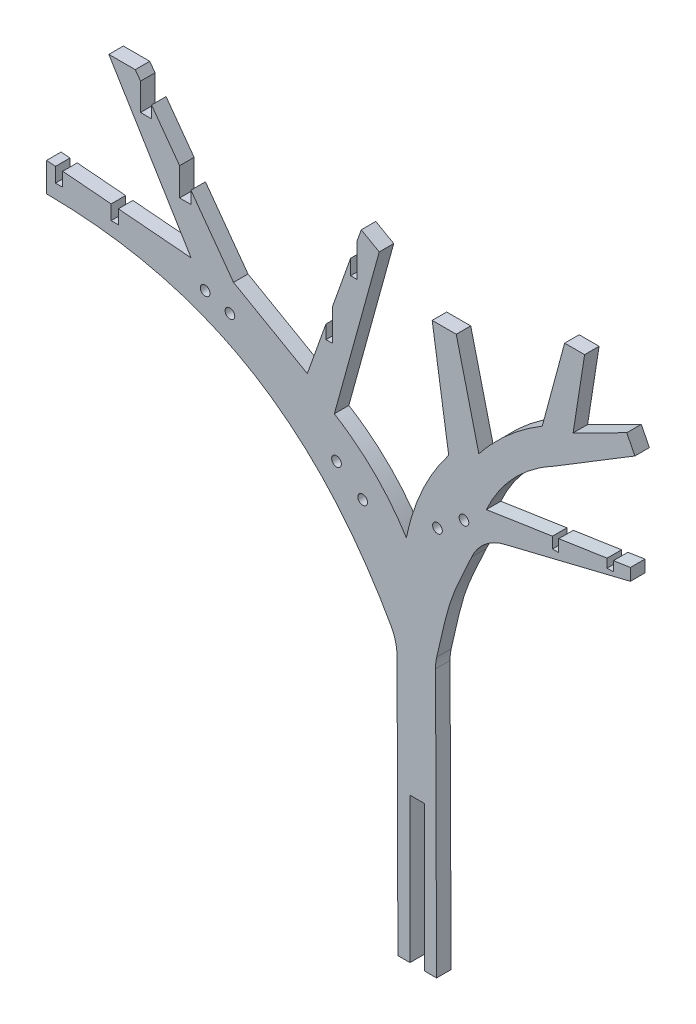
ISO-10303-21;
HEADER;
FILE_DESCRIPTION(('STEP AP214'),'2;1');
FILE_NAME('part.step','',(''),(''),'','','');
FILE_SCHEMA(('AUTOMOTIVE_DESIGN { 1 0 10303 214 1 1 1 1 }'));
ENDSEC;
DATA;
#1=APPLICATION_CONTEXT('core data for automotive mechanical design processes');
#2=APPLICATION_PROTOCOL_DEFINITION('international standard','automotive_design',2000,#1);
#3=PRODUCT_CONTEXT('',#1,'mechanical');
#4=PRODUCT('Part','Part','',(#3));
#5=PRODUCT_RELATED_PRODUCT_CATEGORY('part','',(#4));
#6=PRODUCT_DEFINITION_FORMATION('','',#4);
#7=PRODUCT_DEFINITION_CONTEXT('part definition',#1,'design');
#8=PRODUCT_DEFINITION('design','',#6,#7);
#9=PRODUCT_DEFINITION_SHAPE('','',#8);
#10=(LENGTH_UNIT() NAMED_UNIT(*) SI_UNIT(.MILLI.,.METRE.));
#11=(NAMED_UNIT(*) PLANE_ANGLE_UNIT() SI_UNIT($,.RADIAN.));
#12=(NAMED_UNIT(*) SI_UNIT($,.STERADIAN.) SOLID_ANGLE_UNIT());
#13=UNCERTAINTY_MEASURE_WITH_UNIT(LENGTH_MEASURE(1.E-05),#10,'distance_accuracy_value','');
#14=(GEOMETRIC_REPRESENTATION_CONTEXT(3) GLOBAL_UNCERTAINTY_ASSIGNED_CONTEXT((#13)) GLOBAL_UNIT_ASSIGNED_CONTEXT((#10,
#11,#12)) REPRESENTATION_CONTEXT('',''));
#15=CARTESIAN_POINT('',(0.,0.,0.));
#16=DIRECTION('',(0.,0.,1.));
#17=DIRECTION('',(1.,0.,0.));
#18=AXIS2_PLACEMENT_3D('',#15,#16,#17);
#19=CARTESIAN_POINT('',(2.35107535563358,112.163345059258,3.));
#20=DIRECTION('',(0.,1.,0.));
#21=DIRECTION('',(0.,0.,1.));
#22=AXIS2_PLACEMENT_3D('',#19,#20,#21);
#23=PLANE('',#22);
#24=DIRECTION('',(1.,0.,0.));
#25=VECTOR('',#24,1.);
#26=CARTESIAN_POINT('',(2.35107535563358,112.163345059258,3.));
#27=LINE('',#26,#25);
#28=CARTESIAN_POINT('',(7.85107535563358,112.163345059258,3.));
#29=VERTEX_POINT('',#28);
#30=CARTESIAN_POINT('',(10.3510753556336,112.163345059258,3.));
#31=VERTEX_POINT('',#30);
#32=EDGE_CURVE('E741',#29,#31,#27,.T.);
#33=ORIENTED_EDGE('',*,*,#32,.F.);
#34=DIRECTION('',(0.,0.,1.));
#35=VECTOR('',#34,1.);
#36=CARTESIAN_POINT('',(7.85107535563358,112.163345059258,-7.));
#37=LINE('',#36,#35);
#38=CARTESIAN_POINT('',(7.85107535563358,112.163345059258,0.));
#39=VERTEX_POINT('',#38);
#40=EDGE_CURVE('E489',#39,#29,#37,.T.);
#41=ORIENTED_EDGE('',*,*,#40,.F.);
#42=DIRECTION('',(1.,0.,0.));
#43=VECTOR('',#42,1.);
#44=CARTESIAN_POINT('',(2.35107535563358,112.163345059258,0.));
#45=LINE('',#44,#43);
#46=CARTESIAN_POINT('',(10.3510753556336,112.163345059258,0.));
#47=VERTEX_POINT('',#46);
#48=EDGE_CURVE('E737',#39,#47,#45,.T.);
#49=ORIENTED_EDGE('',*,*,#48,.T.);
#50=DIRECTION('',(0.,0.,-1.));
#51=VECTOR('',#50,1.);
#52=CARTESIAN_POINT('',(10.3510753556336,112.163345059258,3.));
#53=LINE('',#52,#51);
#54=EDGE_CURVE('E787',#31,#47,#53,.T.);
#55=ORIENTED_EDGE('',*,*,#54,.F.);
#56=EDGE_LOOP('',(#33,#41,#49,#55));
#57=FACE_BOUND('',#56,.T.);
#58=ADVANCED_FACE('F45',(#57),#23,.F.);
#59=CARTESIAN_POINT('',(20.6343285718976,201.1978968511,3.));
#60=DIRECTION('',(0.150340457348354,-0.988634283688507,0.));
#61=DIRECTION('',(0.988634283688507,0.150340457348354,0.));
#62=AXIS2_PLACEMENT_3D('',#59,#60,#61);
#63=PLANE('',#62);
#64=DIRECTION('',(-0.988634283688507,-0.150340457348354,0.));
#65=VECTOR('',#64,1.);
#66=CARTESIAN_POINT('',(20.6343285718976,201.1978968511,3.));
#67=LINE('',#66,#65);
#68=CARTESIAN_POINT('',(45.6133653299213,204.996429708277,3.));
#69=VERTEX_POINT('',#68);
#70=CARTESIAN_POINT('',(35.6133653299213,203.475741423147,3.));
#71=VERTEX_POINT('',#70);
#72=EDGE_CURVE('E1702',#69,#71,#67,.T.);
#73=ORIENTED_EDGE('',*,*,#72,.F.);
#74=DIRECTION('',(0.,0.,-1.));
#75=VECTOR('',#74,1.);
#76=CARTESIAN_POINT('',(45.6133653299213,204.996429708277,3.));
#77=LINE('',#76,#75);
#78=CARTESIAN_POINT('',(45.6133653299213,204.996429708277,0.));
#79=VERTEX_POINT('',#78);
#80=EDGE_CURVE('E731',#69,#79,#77,.T.);
#81=ORIENTED_EDGE('',*,*,#80,.T.);
#82=DIRECTION('',(-0.988634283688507,-0.150340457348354,0.));
#83=VECTOR('',#82,1.);
#84=CARTESIAN_POINT('',(20.6343285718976,201.1978968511,0.));
#85=LINE('',#84,#83);
#86=CARTESIAN_POINT('',(35.6133653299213,203.475741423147,0.));
#87=VERTEX_POINT('',#86);
#88=EDGE_CURVE('E942',#79,#87,#85,.T.);
#89=ORIENTED_EDGE('',*,*,#88,.T.);
#90=DIRECTION('',(0.,0.,1.));
#91=VECTOR('',#90,1.);
#92=CARTESIAN_POINT('',(35.6133653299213,203.475741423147,0.));
#93=LINE('',#92,#91);
#94=EDGE_CURVE('E534',#87,#71,#93,.T.);
#95=ORIENTED_EDGE('',*,*,#94,.T.);
#96=EDGE_LOOP('',(#73,#81,#89,#95));
#97=FACE_BOUND('',#96,.T.);
#98=ADVANCED_FACE('F775',(#97),#63,.F.);
#99=CARTESIAN_POINT('',(34.3133653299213,203.27805194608,3.));
#100=VERTEX_POINT('',#99);
#101=CARTESIAN_POINT('',(20.6343285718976,201.1978968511,3.));
#102=VERTEX_POINT('',#101);
#103=EDGE_CURVE('E1690',#100,#102,#67,.T.);
#104=ORIENTED_EDGE('',*,*,#103,.F.);
#105=DIRECTION('',(0.,0.,-1.));
#106=VECTOR('',#105,1.);
#107=CARTESIAN_POINT('',(34.3133653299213,203.27805194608,3.));
#108=LINE('',#107,#106);
#109=CARTESIAN_POINT('',(34.3133653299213,203.27805194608,0.));
#110=VERTEX_POINT('',#109);
#111=EDGE_CURVE('E711',#100,#110,#108,.T.);
#112=ORIENTED_EDGE('',*,*,#111,.T.);
#113=CARTESIAN_POINT('',(20.6343285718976,201.1978968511,0.));
#114=VERTEX_POINT('',#113);
#115=EDGE_CURVE('E937',#110,#114,#85,.T.);
#116=ORIENTED_EDGE('',*,*,#115,.T.);
#117=DIRECTION('',(0.,0.,-1.));
#118=VECTOR('',#117,1.);
#119=CARTESIAN_POINT('',(20.6343285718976,201.1978968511,3.));
#120=LINE('',#119,#118);
#121=EDGE_CURVE('E875',#102,#114,#120,.T.);
#122=ORIENTED_EDGE('',*,*,#121,.F.);
#123=EDGE_LOOP('',(#104,#112,#116,#122));
#124=FACE_BOUND('',#123,.T.);
#125=ADVANCED_FACE('F780',(#124),#63,.F.);
#126=CARTESIAN_POINT('',(-16.3778485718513,207.037706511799,3.));
#127=DIRECTION('',(0.942088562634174,-0.335364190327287,0.));
#128=DIRECTION('',(0.335364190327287,0.942088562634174,0.));
#129=AXIS2_PLACEMENT_3D('',#126,#127,#128);
#130=PLANE('',#129);
#131=DIRECTION('',(-0.335364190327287,-0.942088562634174,0.));
#132=VECTOR('',#131,1.);
#133=CARTESIAN_POINT('',(-16.3778485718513,207.037706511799,3.));
#134=LINE('',#133,#132);
#135=CARTESIAN_POINT('',(-12.523765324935,217.86440730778,3.));
#136=VERTEX_POINT('',#135);
#137=CARTESIAN_POINT('',(-16.3778485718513,207.037706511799,3.));
#138=VERTEX_POINT('',#137);
#139=EDGE_CURVE('E1127',#136,#138,#134,.T.);
#140=ORIENTED_EDGE('',*,*,#139,.F.);
#141=DIRECTION('',(0.,0.,-1.));
#142=VECTOR('',#141,1.);
#143=CARTESIAN_POINT('',(-12.523765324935,217.86440730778,3.));
#144=LINE('',#143,#142);
#145=CARTESIAN_POINT('',(-12.523765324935,217.86440730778,0.));
#146=VERTEX_POINT('',#145);
#147=EDGE_CURVE('E722',#136,#146,#144,.T.);
#148=ORIENTED_EDGE('',*,*,#147,.T.);
#149=DIRECTION('',(-0.335364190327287,-0.942088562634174,0.));
#150=VECTOR('',#149,1.);
#151=CARTESIAN_POINT('',(-16.3778485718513,207.037706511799,0.));
#152=LINE('',#151,#150);
#153=CARTESIAN_POINT('',(-16.3778485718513,207.037706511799,0.));
#154=VERTEX_POINT('',#153);
#155=EDGE_CURVE('E997',#146,#154,#152,.T.);
#156=ORIENTED_EDGE('',*,*,#155,.T.);
#157=DIRECTION('',(0.,0.,-1.));
#158=VECTOR('',#157,1.);
#159=CARTESIAN_POINT('',(-16.3778485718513,207.037706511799,3.));
#160=LINE('',#159,#158);
#161=EDGE_CURVE('E827',#138,#154,#160,.T.);
#162=ORIENTED_EDGE('',*,*,#161,.F.);
#163=EDGE_LOOP('',(#140,#148,#156,#162));
#164=FACE_BOUND('',#163,.T.);
#165=ADVANCED_FACE('F1093',(#164),#130,.F.);
#166=CARTESIAN_POINT('',(-7.42291629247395,232.193461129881,0.));
#167=VERTEX_POINT('',#166);
#168=CARTESIAN_POINT('',(-11.223765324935,221.516303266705,0.));
#169=VERTEX_POINT('',#168);
#170=EDGE_CURVE('E1002',#167,#169,#152,.T.);
#171=ORIENTED_EDGE('',*,*,#170,.T.);
#172=DIRECTION('',(0.,0.,1.));
#173=VECTOR('',#172,1.);
#174=CARTESIAN_POINT('',(-11.223765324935,221.516303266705,0.));
#175=LINE('',#174,#173);
#176=CARTESIAN_POINT('',(-11.223765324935,221.516303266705,3.));
#177=VERTEX_POINT('',#176);
#178=EDGE_CURVE('E601',#169,#177,#175,.T.);
#179=ORIENTED_EDGE('',*,*,#178,.T.);
#180=CARTESIAN_POINT('',(-7.42291629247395,232.193461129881,3.));
#181=VERTEX_POINT('',#180);
#182=EDGE_CURVE('E1132',#181,#177,#134,.T.);
#183=ORIENTED_EDGE('',*,*,#182,.F.);
#184=DIRECTION('',(0.,0.,-1.));
#185=VECTOR('',#184,1.);
#186=CARTESIAN_POINT('',(-7.42291629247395,232.193461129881,3.));
#187=LINE('',#186,#185);
#188=EDGE_CURVE('E716',#181,#167,#187,.T.);
#189=ORIENTED_EDGE('',*,*,#188,.T.);
#190=EDGE_LOOP('',(#171,#179,#183,#189));
#191=FACE_BOUND('',#190,.T.);
#192=ADVANCED_FACE('F1094',(#191),#130,.F.);
#193=CARTESIAN_POINT('',(-51.9703300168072,243.694191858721,3.));
#194=DIRECTION('',(-0.80867518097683,-0.588255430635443,0.));
#195=DIRECTION('',(0.588255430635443,-0.80867518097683,0.));
#196=AXIS2_PLACEMENT_3D('',#193,#194,#195);
#197=PLANE('',#196);
#198=DIRECTION('',(-0.588255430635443,0.80867518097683,0.));
#199=VECTOR('',#198,1.);
#200=CARTESIAN_POINT('',(-51.9703300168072,243.694191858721,3.));
#201=LINE('',#200,#199);
#202=CARTESIAN_POINT('',(-42.7935607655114,231.078880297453,3.));
#203=VERTEX_POINT('',#202);
#204=CARTESIAN_POINT('',(-48.5973626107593,239.057371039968,3.));
#205=VERTEX_POINT('',#204);
#206=EDGE_CURVE('E1144',#203,#205,#201,.T.);
#207=ORIENTED_EDGE('',*,*,#206,.F.);
#208=DIRECTION('',(0.,0.,1.));
#209=VECTOR('',#208,1.);
#210=CARTESIAN_POINT('',(-42.7935607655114,231.078880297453,0.));
#211=LINE('',#210,#209);
#212=CARTESIAN_POINT('',(-42.7935607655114,231.078880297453,0.));
#213=VERTEX_POINT('',#212);
#214=EDGE_CURVE('E521',#213,#203,#211,.T.);
#215=ORIENTED_EDGE('',*,*,#214,.F.);
#216=DIRECTION('',(-0.588255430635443,0.80867518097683,0.));
#217=VECTOR('',#216,1.);
#218=CARTESIAN_POINT('',(-51.9703300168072,243.694191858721,0.));
#219=LINE('',#218,#217);
#220=CARTESIAN_POINT('',(-48.5973626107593,239.057371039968,0.));
#221=VERTEX_POINT('',#220);
#222=EDGE_CURVE('E1014',#213,#221,#219,.T.);
#223=ORIENTED_EDGE('',*,*,#222,.T.);
#224=DIRECTION('',(0.,0.,1.));
#225=VECTOR('',#224,1.);
#226=CARTESIAN_POINT('',(-48.5973626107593,239.057371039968,3.));
#227=LINE('',#226,#225);
#228=EDGE_CURVE('E719',#221,#205,#227,.T.);
#229=ORIENTED_EDGE('',*,*,#228,.T.);
#230=EDGE_LOOP('',(#207,#215,#223,#229));
#231=FACE_BOUND('',#230,.T.);
#232=ADVANCED_FACE('F1083',(#231),#197,.F.);
#233=CARTESIAN_POINT('',(-50.8700385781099,242.181620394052,3.));
#234=VERTEX_POINT('',#233);
#235=CARTESIAN_POINT('',(-51.9703300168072,243.694191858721,3.));
#236=VERTEX_POINT('',#235);
#237=EDGE_CURVE('E1136',#234,#236,#201,.T.);
#238=ORIENTED_EDGE('',*,*,#237,.F.);
#239=DIRECTION('',(0.,0.,1.));
#240=VECTOR('',#239,1.);
#241=CARTESIAN_POINT('',(-50.8700385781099,242.181620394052,0.));
#242=LINE('',#241,#240);
#243=CARTESIAN_POINT('',(-50.8700385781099,242.181620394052,0.));
#244=VERTEX_POINT('',#243);
#245=EDGE_CURVE('E561',#244,#234,#242,.T.);
#246=ORIENTED_EDGE('',*,*,#245,.F.);
#247=CARTESIAN_POINT('',(-51.9703300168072,243.694191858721,0.));
#248=VERTEX_POINT('',#247);
#249=EDGE_CURVE('E1006',#244,#248,#219,.T.);
#250=ORIENTED_EDGE('',*,*,#249,.T.);
#251=DIRECTION('',(0.,0.,-1.));
#252=VECTOR('',#251,1.);
#253=CARTESIAN_POINT('',(-51.9703300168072,243.694191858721,3.));
#254=LINE('',#253,#252);
#255=EDGE_CURVE('E821',#236,#248,#254,.T.);
#256=ORIENTED_EDGE('',*,*,#255,.F.);
#257=EDGE_LOOP('',(#238,#246,#250,#256));
#258=FACE_BOUND('',#257,.T.);
#259=ADVANCED_FACE('F1084',(#258),#197,.F.);
#260=CARTESIAN_POINT('',(-70.300056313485,218.278545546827,3.));
#261=DIRECTION('',(-0.0841808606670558,-0.996450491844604,0.));
#262=DIRECTION('',(0.996450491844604,-0.0841808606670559,0.));
#263=AXIS2_PLACEMENT_3D('',#260,#261,#262);
#264=PLANE('',#263);
#265=DIRECTION('',(-0.996450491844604,0.0841808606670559,0.));
#266=VECTOR('',#265,1.);
#267=CARTESIAN_POINT('',(-70.300056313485,218.278545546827,3.));
#268=LINE('',#267,#266);
#269=CARTESIAN_POINT('',(-68.4627555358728,218.123329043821,3.));
#270=VERTEX_POINT('',#269);
#271=CARTESIAN_POINT('',(-70.300056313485,218.278545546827,3.));
#272=VERTEX_POINT('',#271);
#273=EDGE_CURVE('E1147',#270,#272,#268,.T.);
#274=ORIENTED_EDGE('',*,*,#273,.F.);
#275=DIRECTION('',(0.,0.,1.));
#276=VECTOR('',#275,1.);
#277=CARTESIAN_POINT('',(-68.4627555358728,218.123329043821,0.));
#278=LINE('',#277,#276);
#279=CARTESIAN_POINT('',(-68.4627555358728,218.123329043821,0.));
#280=VERTEX_POINT('',#279);
#281=EDGE_CURVE('E638',#280,#270,#278,.T.);
#282=ORIENTED_EDGE('',*,*,#281,.F.);
#283=DIRECTION('',(-0.996450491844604,0.0841808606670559,0.));
#284=VECTOR('',#283,1.);
#285=CARTESIAN_POINT('',(-70.300056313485,218.278545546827,0.));
#286=LINE('',#285,#284);
#287=CARTESIAN_POINT('',(-70.300056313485,218.278545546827,0.));
#288=VERTEX_POINT('',#287);
#289=EDGE_CURVE('E1018',#280,#288,#286,.T.);
#290=ORIENTED_EDGE('',*,*,#289,.T.);
#291=DIRECTION('',(0.,0.,-1.));
#292=VECTOR('',#291,1.);
#293=CARTESIAN_POINT('',(-70.300056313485,218.278545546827,3.));
#294=LINE('',#293,#292);
#295=EDGE_CURVE('E812',#272,#288,#294,.T.);
#296=ORIENTED_EDGE('',*,*,#295,.F.);
#297=EDGE_LOOP('',(#274,#282,#290,#296));
#298=FACE_BOUND('',#297,.T.);
#299=ADVANCED_FACE('F1070',(#298),#264,.F.);
#300=CARTESIAN_POINT('',(-56.9627555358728,217.151800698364,0.));
#301=VERTEX_POINT('',#300);
#302=CARTESIAN_POINT('',(-66.9627555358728,217.996607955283,0.));
#303=VERTEX_POINT('',#302);
#304=EDGE_CURVE('E1023',#301,#303,#286,.T.);
#305=ORIENTED_EDGE('',*,*,#304,.T.);
#306=DIRECTION('',(0.,0.,1.));
#307=VECTOR('',#306,1.);
#308=CARTESIAN_POINT('',(-66.9627555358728,217.996607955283,3.));
#309=LINE('',#308,#307);
#310=CARTESIAN_POINT('',(-66.9627555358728,217.996607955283,3.));
#311=VERTEX_POINT('',#310);
#312=EDGE_CURVE('E734',#303,#311,#309,.T.);
#313=ORIENTED_EDGE('',*,*,#312,.T.);
#314=CARTESIAN_POINT('',(-56.9627555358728,217.151800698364,3.));
#315=VERTEX_POINT('',#314);
#316=EDGE_CURVE('E1150',#315,#311,#268,.T.);
#317=ORIENTED_EDGE('',*,*,#316,.F.);
#318=DIRECTION('',(0.,0.,1.));
#319=VECTOR('',#318,1.);
#320=CARTESIAN_POINT('',(-56.9627555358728,217.151800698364,0.));
#321=LINE('',#320,#319);
#322=EDGE_CURVE('E674',#301,#315,#321,.T.);
#323=ORIENTED_EDGE('',*,*,#322,.F.);
#324=EDGE_LOOP('',(#305,#313,#317,#323));
#325=FACE_BOUND('',#324,.T.);
#326=ADVANCED_FACE('F772',(#325),#264,.F.);
#327=CARTESIAN_POINT('',(2.35107535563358,112.163345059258,0.));
#328=VERTEX_POINT('',#327);
#329=CARTESIAN_POINT('',(4.85107535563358,112.163345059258,0.));
#330=VERTEX_POINT('',#329);
#331=EDGE_CURVE('E916',#328,#330,#45,.T.);
#332=ORIENTED_EDGE('',*,*,#331,.T.);
#333=DIRECTION('',(0.,0.,1.));
#334=VECTOR('',#333,1.);
#335=CARTESIAN_POINT('',(4.85107535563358,112.163345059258,-7.));
#336=LINE('',#335,#334);
#337=CARTESIAN_POINT('',(4.85107535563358,112.163345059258,3.));
#338=VERTEX_POINT('',#337);
#339=EDGE_CURVE('E500',#330,#338,#336,.T.);
#340=ORIENTED_EDGE('',*,*,#339,.T.);
#341=CARTESIAN_POINT('',(2.35107535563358,112.163345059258,3.));
#342=VERTEX_POINT('',#341);
#343=EDGE_CURVE('E738',#342,#338,#27,.T.);
#344=ORIENTED_EDGE('',*,*,#343,.F.);
#345=DIRECTION('',(0.,0.,-1.));
#346=VECTOR('',#345,1.);
#347=CARTESIAN_POINT('',(2.35107535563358,112.163345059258,3.));
#348=LINE('',#347,#346);
#349=EDGE_CURVE('E801',#342,#328,#348,.T.);
#350=ORIENTED_EDGE('',*,*,#349,.T.);
#351=EDGE_LOOP('',(#332,#340,#344,#350));
#352=FACE_BOUND('',#351,.T.);
#353=ADVANCED_FACE('F47',(#352),#23,.F.);
#354=CARTESIAN_POINT('',(10.3510753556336,112.163345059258,3.));
#355=DIRECTION('',(-0.999992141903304,-0.00396435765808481,0.));
#356=DIRECTION('',(0.00396435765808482,-0.999992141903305,0.));
#357=AXIS2_PLACEMENT_3D('',#354,#355,#356);
#358=PLANE('',#357);
#359=DIRECTION('',(-0.00396435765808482,0.999992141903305,0.));
#360=VECTOR('',#359,1.);
#361=CARTESIAN_POINT('',(10.3510753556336,112.163345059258,0.));
#362=LINE('',#361,#360);
#363=CARTESIAN_POINT('',(10.1320090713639,167.421871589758,0.));
#364=VERTEX_POINT('',#363);
#365=EDGE_CURVE('E915',#47,#364,#362,.T.);
#366=ORIENTED_EDGE('',*,*,#365,.T.);
#367=DIRECTION('',(0.,0.,-1.));
#368=VECTOR('',#367,1.);
#369=CARTESIAN_POINT('',(10.1320090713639,167.421871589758,3.));
#370=LINE('',#369,#368);
#371=CARTESIAN_POINT('',(10.1320090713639,167.421871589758,3.));
#372=VERTEX_POINT('',#371);
#373=EDGE_CURVE('E893',#372,#364,#370,.T.);
#374=ORIENTED_EDGE('',*,*,#373,.F.);
#375=DIRECTION('',(-0.00396435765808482,0.999992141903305,0.));
#376=VECTOR('',#375,1.);
#377=CARTESIAN_POINT('',(10.3510753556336,112.163345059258,3.));
#378=LINE('',#377,#376);
#379=EDGE_CURVE('E740',#31,#372,#378,.T.);
#380=ORIENTED_EDGE('',*,*,#379,.F.);
#381=ORIENTED_EDGE('',*,*,#54,.T.);
#382=EDGE_LOOP('',(#366,#374,#380,#381));
#383=FACE_BOUND('',#382,.T.);
#384=ADVANCED_FACE('F765',(#383),#358,.F.);
#385=CARTESIAN_POINT('',(20.1319304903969,167.461515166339,3.));
#386=DIRECTION('',(0.,0.,-1.));
#387=DIRECTION('',(-1.,0.,0.));
#388=AXIS2_PLACEMENT_3D('',#385,#386,#387);
#389=CYLINDRICAL_SURFACE('',#388,10.);
#390=CARTESIAN_POINT('',(20.1319304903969,167.461515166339,0.));
#391=DIRECTION('',(0.,0.,-1.));
#392=DIRECTION('',(-1.,0.,0.));
#393=AXIS2_PLACEMENT_3D('',#390,#391,#392);
#394=CIRCLE('',#393,10.);
#395=CARTESIAN_POINT('',(10.3749067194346,169.6525165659,0.));
#396=VERTEX_POINT('',#395);
#397=EDGE_CURVE('E922',#364,#396,#394,.T.);
#398=ORIENTED_EDGE('',*,*,#397,.T.);
#399=DIRECTION('',(0.,0.,-1.));
#400=VECTOR('',#399,1.);
#401=CARTESIAN_POINT('',(10.3749067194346,169.6525165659,3.));
#402=LINE('',#401,#400);
#403=CARTESIAN_POINT('',(10.3749067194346,169.6525165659,3.));
#404=VERTEX_POINT('',#403);
#405=EDGE_CURVE('E890',#404,#396,#402,.T.);
#406=ORIENTED_EDGE('',*,*,#405,.F.);
#407=CARTESIAN_POINT('',(20.1319304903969,167.461515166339,3.));
#408=DIRECTION('',(0.,0.,-1.));
#409=DIRECTION('',(-1.,0.,0.));
#410=AXIS2_PLACEMENT_3D('',#407,#408,#409);
#411=CIRCLE('',#410,10.);
#412=EDGE_CURVE('E743',#372,#404,#411,.T.);
#413=ORIENTED_EDGE('',*,*,#412,.F.);
#414=ORIENTED_EDGE('',*,*,#373,.T.);
#415=EDGE_LOOP('',(#398,#406,#413,#414));
#416=FACE_BOUND('',#415,.T.);
#417=ADVANCED_FACE('F761',(#416),#389,.F.);
#418=CARTESIAN_POINT('',(10.3749067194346,169.6525165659,3.));
#419=CARTESIAN_POINT('',(12.3606277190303,178.495380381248,3.));
#420=CARTESIAN_POINT('',(13.3153549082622,182.026541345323,3.));
#421=CARTESIAN_POINT('',(16.095725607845,187.806098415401,3.));
#422=CARTESIAN_POINT('',(17.6107593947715,191.207392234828,3.));
#423=B_SPLINE_CURVE_WITH_KNOTS('',3,(#418,#419,#420,#421,#422),.UNSPECIFIED.,.F.,.F.,(4,1,4),
(0.0943156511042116,0.680602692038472,0.983634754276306),.UNSPECIFIED.);
#424=DIRECTION('',(0.,0.,-1.));
#425=VECTOR('',#424,1.);
#426=SURFACE_OF_LINEAR_EXTRUSION('',#423,#425);
#427=CARTESIAN_POINT('',(10.3749067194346,169.6525165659,0.));
#428=CARTESIAN_POINT('',(12.3606277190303,178.495380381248,0.));
#429=CARTESIAN_POINT('',(13.3153549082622,182.026541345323,0.));
#430=CARTESIAN_POINT('',(16.095725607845,187.806098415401,0.));
#431=CARTESIAN_POINT('',(17.6107593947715,191.207392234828,0.));
#432=B_SPLINE_CURVE_WITH_KNOTS('',3,(#427,#428,#429,#430,#431),.UNSPECIFIED.,.F.,.F.,(4,1,4),
(0.0943156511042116,0.680602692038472,0.983634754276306),.UNSPECIFIED.);
#433=CARTESIAN_POINT('',(17.6107593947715,191.207392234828,0.));
#434=VERTEX_POINT('',#433);
#435=EDGE_CURVE('E924',#396,#434,#432,.T.);
#436=ORIENTED_EDGE('',*,*,#435,.T.);
#437=DIRECTION('',(0.,0.,-1.));
#438=VECTOR('',#437,1.);
#439=CARTESIAN_POINT('',(17.6107593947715,191.207392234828,3.));
#440=LINE('',#439,#438);
#441=CARTESIAN_POINT('',(17.6107593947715,191.207392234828,3.));
#442=VERTEX_POINT('',#441);
#443=EDGE_CURVE('E887',#442,#434,#440,.T.);
#444=ORIENTED_EDGE('',*,*,#443,.F.);
#445=EDGE_CURVE('E745',#404,#442,#423,.T.);
#446=ORIENTED_EDGE('',*,*,#445,.F.);
#447=ORIENTED_EDGE('',*,*,#405,.T.);
#448=EDGE_LOOP('',(#436,#444,#446,#447));
#449=FACE_BOUND('',#448,.T.);
#450=ADVANCED_FACE('F756',(#449),#426,.F.);
#451=CARTESIAN_POINT('',(26.7455350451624,187.138501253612,3.));
#452=DIRECTION('',(0.,0.,-1.));
#453=DIRECTION('',(-1.,0.,0.));
#454=AXIS2_PLACEMENT_3D('',#451,#452,#453);
#455=CYLINDRICAL_SURFACE('',#454,10.);
#456=CARTESIAN_POINT('',(26.7455350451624,187.138501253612,0.));
#457=DIRECTION('',(0.,0.,-1.));
#458=DIRECTION('',(1.,0.,0.));
#459=AXIS2_PLACEMENT_3D('',#456,#457,#458);
#460=CIRCLE('',#459,10.);
#461=CARTESIAN_POINT('',(24.3641933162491,196.850823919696,0.));
#462=VERTEX_POINT('',#461);
#463=EDGE_CURVE('E928',#434,#462,#460,.T.);
#464=ORIENTED_EDGE('',*,*,#463,.T.);
#465=DIRECTION('',(0.,0.,-1.));
#466=VECTOR('',#465,1.);
#467=CARTESIAN_POINT('',(24.3641933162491,196.850823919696,3.));
#468=LINE('',#467,#466);
#469=CARTESIAN_POINT('',(24.3641933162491,196.850823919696,3.));
#470=VERTEX_POINT('',#469);
#471=EDGE_CURVE('E884',#470,#462,#468,.T.);
#472=ORIENTED_EDGE('',*,*,#471,.F.);
#473=CARTESIAN_POINT('',(26.7455350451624,187.138501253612,3.));
#474=DIRECTION('',(0.,0.,-1.));
#475=DIRECTION('',(1.,0.,0.));
#476=AXIS2_PLACEMENT_3D('',#473,#474,#475);
#477=CIRCLE('',#476,10.);
#478=EDGE_CURVE('E750',#442,#470,#477,.T.);
#479=ORIENTED_EDGE('',*,*,#478,.F.);
#480=ORIENTED_EDGE('',*,*,#443,.T.);
#481=EDGE_LOOP('',(#464,#472,#479,#480));
#482=FACE_BOUND('',#481,.T.);
#483=ADVANCED_FACE('F760',(#482),#455,.F.);
#484=CARTESIAN_POINT('',(50.4311267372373,203.242114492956,3.));
#485=DIRECTION('',(-0.238134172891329,0.971232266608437,0.));
#486=DIRECTION('',(-0.971232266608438,-0.238134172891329,0.));
#487=AXIS2_PLACEMENT_3D('',#484,#485,#486);
#488=PLANE('',#487);
#489=DIRECTION('',(0.971232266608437,0.238134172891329,0.));
#490=VECTOR('',#489,1.);
#491=CARTESIAN_POINT('',(50.4311267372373,203.242114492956,0.));
#492=LINE('',#491,#490);
#493=CARTESIAN_POINT('',(50.4311267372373,203.242114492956,0.));
#494=VERTEX_POINT('',#493);
#495=EDGE_CURVE('E933',#462,#494,#492,.T.);
#496=ORIENTED_EDGE('',*,*,#495,.T.);
#497=DIRECTION('',(0.,0.,-1.));
#498=VECTOR('',#497,1.);
#499=CARTESIAN_POINT('',(50.4311267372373,203.242114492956,3.));
#500=LINE('',#499,#498);
#501=CARTESIAN_POINT('',(50.4311267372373,203.242114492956,3.));
#502=VERTEX_POINT('',#501);
#503=EDGE_CURVE('E881',#502,#494,#500,.T.);
#504=ORIENTED_EDGE('',*,*,#503,.F.);
#505=DIRECTION('',(0.971232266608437,0.238134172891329,0.));
#506=VECTOR('',#505,1.);
#507=CARTESIAN_POINT('',(50.4311267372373,203.242114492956,3.));
#508=LINE('',#507,#506);
#509=EDGE_CURVE('E1706',#470,#502,#508,.T.);
#510=ORIENTED_EDGE('',*,*,#509,.F.);
#511=ORIENTED_EDGE('',*,*,#471,.T.);
#512=EDGE_LOOP('',(#496,#504,#510,#511));
#513=FACE_BOUND('',#512,.T.);
#514=ADVANCED_FACE('F1450',(#513),#488,.F.);
#515=CARTESIAN_POINT('',(50.4311267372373,205.729061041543,3.));
#516=DIRECTION('',(-1.,0.,0.));
#517=DIRECTION('',(0.,0.,1.));
#518=AXIS2_PLACEMENT_3D('',#515,#516,#517);
#519=PLANE('',#518);
#520=DIRECTION('',(0.,1.,0.));
#521=VECTOR('',#520,1.);
#522=CARTESIAN_POINT('',(50.4311267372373,205.729061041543,0.));
#523=LINE('',#522,#521);
#524=CARTESIAN_POINT('',(50.4311267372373,205.729061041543,0.));
#525=VERTEX_POINT('',#524);
#526=EDGE_CURVE('E935',#494,#525,#523,.T.);
#527=ORIENTED_EDGE('',*,*,#526,.T.);
#528=DIRECTION('',(0.,0.,-1.));
#529=VECTOR('',#528,1.);
#530=CARTESIAN_POINT('',(50.4311267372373,205.729061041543,3.));
#531=LINE('',#530,#529);
#532=CARTESIAN_POINT('',(50.4311267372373,205.729061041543,3.));
#533=VERTEX_POINT('',#532);
#534=EDGE_CURVE('E878',#533,#525,#531,.T.);
#535=ORIENTED_EDGE('',*,*,#534,.F.);
#536=DIRECTION('',(0.,1.,0.));
#537=VECTOR('',#536,1.);
#538=CARTESIAN_POINT('',(50.4311267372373,205.729061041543,3.));
#539=LINE('',#538,#537);
#540=EDGE_CURVE('E1705',#502,#533,#539,.T.);
#541=ORIENTED_EDGE('',*,*,#540,.F.);
#542=ORIENTED_EDGE('',*,*,#503,.T.);
#543=EDGE_LOOP('',(#527,#535,#541,#542));
#544=FACE_BOUND('',#543,.T.);
#545=ADVANCED_FACE('F1443',(#544),#519,.F.);
#546=CARTESIAN_POINT('',(46.9133653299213,205.194119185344,0.));
#547=VERTEX_POINT('',#546);
#548=EDGE_CURVE('E938',#525,#547,#85,.T.);
#549=ORIENTED_EDGE('',*,*,#548,.T.);
#550=DIRECTION('',(0.,0.,1.));
#551=VECTOR('',#550,1.);
#552=CARTESIAN_POINT('',(46.9133653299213,205.194119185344,0.));
#553=LINE('',#552,#551);
#554=CARTESIAN_POINT('',(46.9133653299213,205.194119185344,3.));
#555=VERTEX_POINT('',#554);
#556=EDGE_CURVE('E634',#547,#555,#553,.T.);
#557=ORIENTED_EDGE('',*,*,#556,.T.);
#558=EDGE_CURVE('E1616',#533,#555,#67,.T.);
#559=ORIENTED_EDGE('',*,*,#558,.F.);
#560=ORIENTED_EDGE('',*,*,#534,.T.);
#561=EDGE_LOOP('',(#549,#557,#559,#560));
#562=FACE_BOUND('',#561,.T.);
#563=ADVANCED_FACE('F783',(#562),#63,.F.);
#564=CARTESIAN_POINT('',(20.6343285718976,201.1978968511,3.));
#565=CARTESIAN_POINT('',(24.9961760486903,210.756152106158,3.));
#566=CARTESIAN_POINT('',(34.5612669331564,215.927531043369,3.));
#567=B_SPLINE_CURVE_WITH_KNOTS('',2,(#564,#565,#566),.UNSPECIFIED.,.F.,.F.,(3,3),(0.,1.),.UNSPECIFIED.);
#568=DIRECTION('',(0.,0.,-1.));
#569=VECTOR('',#568,1.);
#570=SURFACE_OF_LINEAR_EXTRUSION('',#567,#569);
#571=CARTESIAN_POINT('',(20.6343285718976,201.1978968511,0.));
#572=CARTESIAN_POINT('',(24.9961760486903,210.756152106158,0.));
#573=CARTESIAN_POINT('',(34.5612669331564,215.927531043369,0.));
#574=B_SPLINE_CURVE_WITH_KNOTS('',2,(#571,#572,#573),.UNSPECIFIED.,.F.,.F.,(3,3),(0.,1.),.UNSPECIFIED.);
#575=CARTESIAN_POINT('',(34.5612669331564,215.927531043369,0.));
#576=VERTEX_POINT('',#575);
#577=EDGE_CURVE('E941',#114,#576,#574,.T.);
#578=ORIENTED_EDGE('',*,*,#577,.T.);
#579=DIRECTION('',(0.,0.,-1.));
#580=VECTOR('',#579,1.);
#581=CARTESIAN_POINT('',(34.5612669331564,215.927531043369,3.));
#582=LINE('',#581,#580);
#583=CARTESIAN_POINT('',(34.5612669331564,215.927531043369,3.));
#584=VERTEX_POINT('',#583);
#585=EDGE_CURVE('E872',#584,#576,#582,.T.);
#586=ORIENTED_EDGE('',*,*,#585,.F.);
#587=EDGE_CURVE('E1609',#102,#584,#567,.T.);
#588=ORIENTED_EDGE('',*,*,#587,.F.);
#589=ORIENTED_EDGE('',*,*,#121,.T.);
#590=EDGE_LOOP('',(#578,#586,#588,#589));
#591=FACE_BOUND('',#590,.T.);
#592=ADVANCED_FACE('F1428',(#591),#570,.F.);
#593=CARTESIAN_POINT('',(51.3622206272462,226.159673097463,3.));
#594=DIRECTION('',(-0.520149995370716,0.854074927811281,0.));
#595=DIRECTION('',(-0.854074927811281,-0.520149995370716,0.));
#596=AXIS2_PLACEMENT_3D('',#593,#594,#595);
#597=PLANE('',#596);
#598=DIRECTION('',(0.854074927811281,0.520149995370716,0.));
#599=VECTOR('',#598,1.);
#600=CARTESIAN_POINT('',(51.3622206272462,226.159673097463,0.));
#601=LINE('',#600,#599);
#602=CARTESIAN_POINT('',(51.3622206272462,226.159673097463,0.));
#603=VERTEX_POINT('',#602);
#604=EDGE_CURVE('E946',#576,#603,#601,.T.);
#605=ORIENTED_EDGE('',*,*,#604,.T.);
#606=DIRECTION('',(0.,0.,-1.));
#607=VECTOR('',#606,1.);
#608=CARTESIAN_POINT('',(51.3622206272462,226.159673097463,3.));
#609=LINE('',#608,#607);
#610=CARTESIAN_POINT('',(51.3622206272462,226.159673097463,3.));
#611=VERTEX_POINT('',#610);
#612=EDGE_CURVE('E869',#611,#603,#609,.T.);
#613=ORIENTED_EDGE('',*,*,#612,.F.);
#614=DIRECTION('',(0.854074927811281,0.520149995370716,0.));
#615=VECTOR('',#614,1.);
#616=CARTESIAN_POINT('',(51.3622206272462,226.159673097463,3.));
#617=LINE('',#616,#615);
#618=EDGE_CURVE('E1615',#584,#611,#617,.T.);
#619=ORIENTED_EDGE('',*,*,#618,.F.);
#620=ORIENTED_EDGE('',*,*,#585,.T.);
#621=EDGE_LOOP('',(#605,#613,#619,#620));
#622=FACE_BOUND('',#621,.T.);
#623=ADVANCED_FACE('F1420',(#622),#597,.F.);
#624=CARTESIAN_POINT('',(49.685049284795,229.491603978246,3.));
#625=DIRECTION('',(-0.893222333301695,-0.449615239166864,0.));
#626=DIRECTION('',(0.449615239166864,-0.893222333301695,0.));
#627=AXIS2_PLACEMENT_3D('',#624,#625,#626);
#628=PLANE('',#627);
#629=DIRECTION('',(-0.449615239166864,0.893222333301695,0.));
#630=VECTOR('',#629,1.);
#631=CARTESIAN_POINT('',(49.685049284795,229.491603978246,0.));
#632=LINE('',#631,#630);
#633=CARTESIAN_POINT('',(49.685049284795,229.491603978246,0.));
#634=VERTEX_POINT('',#633);
#635=EDGE_CURVE('E951',#603,#634,#632,.T.);
#636=ORIENTED_EDGE('',*,*,#635,.T.);
#637=DIRECTION('',(0.,0.,-1.));
#638=VECTOR('',#637,1.);
#639=CARTESIAN_POINT('',(49.685049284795,229.491603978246,3.));
#640=LINE('',#639,#638);
#641=CARTESIAN_POINT('',(49.685049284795,229.491603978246,3.));
#642=VERTEX_POINT('',#641);
#643=EDGE_CURVE('E866',#642,#634,#640,.T.);
#644=ORIENTED_EDGE('',*,*,#643,.F.);
#645=DIRECTION('',(-0.449615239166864,0.893222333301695,0.));
#646=VECTOR('',#645,1.);
#647=CARTESIAN_POINT('',(49.685049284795,229.491603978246,3.));
#648=LINE('',#647,#646);
#649=EDGE_CURVE('E1622',#611,#642,#648,.T.);
#650=ORIENTED_EDGE('',*,*,#649,.F.);
#651=ORIENTED_EDGE('',*,*,#612,.T.);
#652=EDGE_LOOP('',(#636,#644,#650,#651));
#653=FACE_BOUND('',#652,.T.);
#654=ADVANCED_FACE('F1412',(#653),#628,.F.);
#655=CARTESIAN_POINT('',(49.685049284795,229.491603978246,3.));
#656=DIRECTION('',(0.449615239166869,-0.893222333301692,0.));
#657=DIRECTION('',(0.893222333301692,0.449615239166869,0.));
#658=AXIS2_PLACEMENT_3D('',#655,#656,#657);
#659=PLANE('',#658);
#660=CARTESIAN_POINT('',(49.685049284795,229.491603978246,0.));
#661=CARTESIAN_POINT('',(44.1355504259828,226.698190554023,0.));
#662=CARTESIAN_POINT('',(38.5860515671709,223.9047771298,0.));
#663=B_SPLINE_CURVE_WITH_KNOTS('',2,(#660,#661,#662),.UNSPECIFIED.,.F.,.F.,(3,3),(0.,1.),.UNSPECIFIED.);
#664=CARTESIAN_POINT('',(38.5860515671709,223.9047771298,0.));
#665=VERTEX_POINT('',#664);
#666=EDGE_CURVE('E953',#634,#665,#663,.T.);
#667=ORIENTED_EDGE('',*,*,#666,.T.);
#668=DIRECTION('',(0.,0.,-1.));
#669=VECTOR('',#668,1.);
#670=CARTESIAN_POINT('',(38.5860515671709,223.9047771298,3.));
#671=LINE('',#670,#669);
#672=CARTESIAN_POINT('',(38.5860515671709,223.9047771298,3.));
#673=VERTEX_POINT('',#672);
#674=EDGE_CURVE('E863',#673,#665,#671,.T.);
#675=ORIENTED_EDGE('',*,*,#674,.F.);
#676=CARTESIAN_POINT('',(49.685049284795,229.491603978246,3.));
#677=CARTESIAN_POINT('',(44.1355504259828,226.698190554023,3.));
#678=CARTESIAN_POINT('',(38.5860515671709,223.9047771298,3.));
#679=B_SPLINE_CURVE_WITH_KNOTS('',2,(#676,#677,#678),.UNSPECIFIED.,.F.,.F.,(3,3),(0.,1.),.UNSPECIFIED.);
#680=EDGE_CURVE('E1624',#642,#673,#679,.T.);
#681=ORIENTED_EDGE('',*,*,#680,.F.);
#682=ORIENTED_EDGE('',*,*,#643,.T.);
#683=EDGE_LOOP('',(#667,#675,#681,#682));
#684=FACE_BOUND('',#683,.T.);
#685=ADVANCED_FACE('F1404',(#684),#659,.F.);
#686=CARTESIAN_POINT('',(40.9622884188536,239.113723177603,3.));
#687=DIRECTION('',(-0.988013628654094,0.154366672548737,0.));
#688=DIRECTION('',(-0.154366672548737,-0.988013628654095,0.));
#689=AXIS2_PLACEMENT_3D('',#686,#687,#688);
#690=PLANE('',#689);
#691=DIRECTION('',(0.154366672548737,0.988013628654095,0.));
#692=VECTOR('',#691,1.);
#693=CARTESIAN_POINT('',(40.9622884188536,239.113723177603,0.));
#694=LINE('',#693,#692);
#695=CARTESIAN_POINT('',(40.9622884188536,239.113723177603,0.));
#696=VERTEX_POINT('',#695);
#697=EDGE_CURVE('E957',#665,#696,#694,.T.);
#698=ORIENTED_EDGE('',*,*,#697,.T.);
#699=DIRECTION('',(0.,0.,-1.));
#700=VECTOR('',#699,1.);
#701=CARTESIAN_POINT('',(40.9622884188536,239.113723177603,3.));
#702=LINE('',#701,#700);
#703=CARTESIAN_POINT('',(40.9622884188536,239.113723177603,3.));
#704=VERTEX_POINT('',#703);
#705=EDGE_CURVE('E860',#704,#696,#702,.T.);
#706=ORIENTED_EDGE('',*,*,#705,.F.);
#707=DIRECTION('',(0.154366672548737,0.988013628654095,0.));
#708=VECTOR('',#707,1.);
#709=CARTESIAN_POINT('',(40.9622884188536,239.113723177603,3.));
#710=LINE('',#709,#708);
#711=EDGE_CURVE('E1628',#673,#704,#710,.T.);
#712=ORIENTED_EDGE('',*,*,#711,.F.);
#713=ORIENTED_EDGE('',*,*,#674,.T.);
#714=EDGE_LOOP('',(#698,#706,#712,#713));
#715=FACE_BOUND('',#714,.T.);
#716=ADVANCED_FACE('F1396',(#715),#690,.F.);
#717=CARTESIAN_POINT('',(36.832861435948,239.113723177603,3.));
#718=DIRECTION('',(0.,-1.,0.));
#719=DIRECTION('',(0.,0.,-1.));
#720=AXIS2_PLACEMENT_3D('',#717,#718,#719);
#721=PLANE('',#720);
#722=DIRECTION('',(-1.,0.,0.));
#723=VECTOR('',#722,1.);
#724=CARTESIAN_POINT('',(36.832861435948,239.113723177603,0.));
#725=LINE('',#724,#723);
#726=CARTESIAN_POINT('',(36.832861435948,239.113723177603,0.));
#727=VERTEX_POINT('',#726);
#728=EDGE_CURVE('E962',#696,#727,#725,.T.);
#729=ORIENTED_EDGE('',*,*,#728,.T.);
#730=DIRECTION('',(0.,0.,-1.));
#731=VECTOR('',#730,1.);
#732=CARTESIAN_POINT('',(36.832861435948,239.113723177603,3.));
#733=LINE('',#732,#731);
#734=CARTESIAN_POINT('',(36.832861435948,239.113723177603,3.));
#735=VERTEX_POINT('',#734);
#736=EDGE_CURVE('E857',#735,#727,#733,.T.);
#737=ORIENTED_EDGE('',*,*,#736,.F.);
#738=DIRECTION('',(-1.,0.,0.));
#739=VECTOR('',#738,1.);
#740=CARTESIAN_POINT('',(36.832861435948,239.113723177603,3.));
#741=LINE('',#740,#739);
#742=EDGE_CURVE('E1633',#704,#735,#741,.T.);
#743=ORIENTED_EDGE('',*,*,#742,.F.);
#744=ORIENTED_EDGE('',*,*,#705,.T.);
#745=EDGE_LOOP('',(#729,#737,#743,#744));
#746=FACE_BOUND('',#745,.T.);
#747=ADVANCED_FACE('F1388',(#746),#721,.F.);
#748=CARTESIAN_POINT('',(32.197853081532,221.927217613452,3.));
#749=DIRECTION('',(0.965504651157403,-0.260385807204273,0.));
#750=DIRECTION('',(0.260385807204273,0.965504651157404,0.));
#751=AXIS2_PLACEMENT_3D('',#748,#749,#750);
#752=PLANE('',#751);
#753=DIRECTION('',(-0.260385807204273,-0.965504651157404,0.));
#754=VECTOR('',#753,1.);
#755=CARTESIAN_POINT('',(32.197853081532,221.927217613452,0.));
#756=LINE('',#755,#754);
#757=CARTESIAN_POINT('',(32.197853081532,221.927217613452,0.));
#758=VERTEX_POINT('',#757);
#759=EDGE_CURVE('E964',#727,#758,#756,.T.);
#760=ORIENTED_EDGE('',*,*,#759,.T.);
#761=DIRECTION('',(0.,0.,-1.));
#762=VECTOR('',#761,1.);
#763=CARTESIAN_POINT('',(32.197853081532,221.927217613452,3.));
#764=LINE('',#763,#762);
#765=CARTESIAN_POINT('',(32.197853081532,221.927217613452,3.));
#766=VERTEX_POINT('',#765);
#767=EDGE_CURVE('E854',#766,#758,#764,.T.);
#768=ORIENTED_EDGE('',*,*,#767,.F.);
#769=DIRECTION('',(-0.260385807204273,-0.965504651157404,0.));
#770=VECTOR('',#769,1.);
#771=CARTESIAN_POINT('',(32.197853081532,221.927217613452,3.));
#772=LINE('',#771,#770);
#773=EDGE_CURVE('E1635',#735,#766,#772,.T.);
#774=ORIENTED_EDGE('',*,*,#773,.F.);
#775=ORIENTED_EDGE('',*,*,#736,.T.);
#776=EDGE_LOOP('',(#760,#768,#774,#775));
#777=FACE_BOUND('',#776,.T.);
#778=ADVANCED_FACE('F1380',(#777),#752,.F.);
#779=CARTESIAN_POINT('',(32.197853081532,221.927217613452,3.));
#780=CARTESIAN_POINT('',(24.6018107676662,217.389360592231,3.));
#781=CARTESIAN_POINT('',(19.0918605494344,210.408407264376,3.));
#782=B_SPLINE_CURVE_WITH_KNOTS('',2,(#779,#780,#781),.UNSPECIFIED.,.F.,.F.,(3,3),(0.,1.),.UNSPECIFIED.);
#783=DIRECTION('',(0.,0.,-1.));
#784=VECTOR('',#783,1.);
#785=SURFACE_OF_LINEAR_EXTRUSION('',#782,#784);
#786=CARTESIAN_POINT('',(32.197853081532,221.927217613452,0.));
#787=CARTESIAN_POINT('',(24.6018107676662,217.389360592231,0.));
#788=CARTESIAN_POINT('',(19.0918605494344,210.408407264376,0.));
#789=B_SPLINE_CURVE_WITH_KNOTS('',2,(#786,#787,#788),.UNSPECIFIED.,.F.,.F.,(3,3),(0.,1.),.UNSPECIFIED.);
#790=CARTESIAN_POINT('',(19.0918605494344,210.408407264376,0.));
#791=VERTEX_POINT('',#790);
#792=EDGE_CURVE('E966',#758,#791,#789,.T.);
#793=ORIENTED_EDGE('',*,*,#792,.T.);
#794=DIRECTION('',(0.,0.,-1.));
#795=VECTOR('',#794,1.);
#796=CARTESIAN_POINT('',(19.0918605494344,210.408407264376,3.));
#797=LINE('',#796,#795);
#798=CARTESIAN_POINT('',(19.0918605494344,210.408407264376,3.));
#799=VERTEX_POINT('',#798);
#800=EDGE_CURVE('E851',#799,#791,#797,.T.);
#801=ORIENTED_EDGE('',*,*,#800,.F.);
#802=EDGE_CURVE('E1637',#766,#799,#782,.T.);
#803=ORIENTED_EDGE('',*,*,#802,.F.);
#804=ORIENTED_EDGE('',*,*,#767,.T.);
#805=EDGE_LOOP('',(#793,#801,#803,#804));
#806=FACE_BOUND('',#805,.T.);
#807=ADVANCED_FACE('F1372',(#806),#785,.F.);
#808=CARTESIAN_POINT('',(14.4128960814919,229.491603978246,3.));
#809=DIRECTION('',(-0.971232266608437,-0.238134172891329,0.));
#810=DIRECTION('',(0.238134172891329,-0.971232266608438,0.));
#811=AXIS2_PLACEMENT_3D('',#808,#809,#810);
#812=PLANE('',#811);
#813=DIRECTION('',(-0.238134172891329,0.971232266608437,0.));
#814=VECTOR('',#813,1.);
#815=CARTESIAN_POINT('',(14.4128960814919,229.491603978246,0.));
#816=LINE('',#815,#814);
#817=CARTESIAN_POINT('',(14.4128960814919,229.491603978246,0.));
#818=VERTEX_POINT('',#817);
#819=EDGE_CURVE('E970',#791,#818,#816,.T.);
#820=ORIENTED_EDGE('',*,*,#819,.T.);
#821=DIRECTION('',(0.,0.,-1.));
#822=VECTOR('',#821,1.);
#823=CARTESIAN_POINT('',(14.4128960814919,229.491603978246,3.));
#824=LINE('',#823,#822);
#825=CARTESIAN_POINT('',(14.4128960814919,229.491603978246,3.));
#826=VERTEX_POINT('',#825);
#827=EDGE_CURVE('E848',#826,#818,#824,.T.);
#828=ORIENTED_EDGE('',*,*,#827,.F.);
#829=DIRECTION('',(-0.238134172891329,0.971232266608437,0.));
#830=VECTOR('',#829,1.);
#831=CARTESIAN_POINT('',(14.4128960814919,229.491603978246,3.));
#832=LINE('',#831,#830);
#833=EDGE_CURVE('E1642',#799,#826,#832,.T.);
#834=ORIENTED_EDGE('',*,*,#833,.F.);
#835=ORIENTED_EDGE('',*,*,#800,.T.);
#836=EDGE_LOOP('',(#820,#828,#834,#835));
#837=FACE_BOUND('',#836,.T.);
#838=ADVANCED_FACE('F1364',(#837),#812,.F.);
#839=CARTESIAN_POINT('',(9.43923455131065,229.491603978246,3.));
#840=DIRECTION('',(0.,-1.,0.));
#841=DIRECTION('',(0.,0.,-1.));
#842=AXIS2_PLACEMENT_3D('',#839,#840,#841);
#843=PLANE('',#842);
#844=DIRECTION('',(-1.,0.,0.));
#845=VECTOR('',#844,1.);
#846=CARTESIAN_POINT('',(9.43923455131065,229.491603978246,0.));
#847=LINE('',#846,#845);
#848=CARTESIAN_POINT('',(9.43923455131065,229.491603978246,0.));
#849=VERTEX_POINT('',#848);
#850=EDGE_CURVE('E975',#818,#849,#847,.T.);
#851=ORIENTED_EDGE('',*,*,#850,.T.);
#852=DIRECTION('',(0.,0.,-1.));
#853=VECTOR('',#852,1.);
#854=CARTESIAN_POINT('',(9.43923455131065,229.491603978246,3.));
#855=LINE('',#854,#853);
#856=CARTESIAN_POINT('',(9.43923455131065,229.491603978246,3.));
#857=VERTEX_POINT('',#856);
#858=EDGE_CURVE('E845',#857,#849,#855,.T.);
#859=ORIENTED_EDGE('',*,*,#858,.F.);
#860=DIRECTION('',(-1.,0.,0.));
#861=VECTOR('',#860,1.);
#862=CARTESIAN_POINT('',(9.43923455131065,229.491603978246,3.));
#863=LINE('',#862,#861);
#864=EDGE_CURVE('E1647',#826,#857,#863,.T.);
#865=ORIENTED_EDGE('',*,*,#864,.F.);
#866=ORIENTED_EDGE('',*,*,#827,.T.);
#867=EDGE_LOOP('',(#851,#859,#865,#866));
#868=FACE_BOUND('',#867,.T.);
#869=ADVANCED_FACE('F1357',(#868),#843,.F.);
#870=CARTESIAN_POINT('',(12.8537724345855,207.037706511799,3.));
#871=DIRECTION('',(0.988634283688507,0.150340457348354,0.));
#872=DIRECTION('',(-0.150340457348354,0.988634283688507,0.));
#873=AXIS2_PLACEMENT_3D('',#870,#871,#872);
#874=PLANE('',#873);
#875=DIRECTION('',(0.150340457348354,-0.988634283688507,0.));
#876=VECTOR('',#875,1.);
#877=CARTESIAN_POINT('',(12.8537724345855,207.037706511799,0.));
#878=LINE('',#877,#876);
#879=CARTESIAN_POINT('',(12.8537724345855,207.037706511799,0.));
#880=VERTEX_POINT('',#879);
#881=EDGE_CURVE('E977',#849,#880,#878,.T.);
#882=ORIENTED_EDGE('',*,*,#881,.T.);
#883=DIRECTION('',(0.,0.,-1.));
#884=VECTOR('',#883,1.);
#885=CARTESIAN_POINT('',(12.8537724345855,207.037706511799,3.));
#886=LINE('',#885,#884);
#887=CARTESIAN_POINT('',(12.8537724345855,207.037706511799,3.));
#888=VERTEX_POINT('',#887);
#889=EDGE_CURVE('E842',#888,#880,#886,.T.);
#890=ORIENTED_EDGE('',*,*,#889,.F.);
#891=DIRECTION('',(0.150340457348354,-0.988634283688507,0.));
#892=VECTOR('',#891,1.);
#893=CARTESIAN_POINT('',(12.8537724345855,207.037706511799,3.));
#894=LINE('',#893,#892);
#895=EDGE_CURVE('E1648',#857,#888,#894,.T.);
#896=ORIENTED_EDGE('',*,*,#895,.F.);
#897=ORIENTED_EDGE('',*,*,#858,.T.);
#898=EDGE_LOOP('',(#882,#890,#896,#897));
#899=FACE_BOUND('',#898,.T.);
#900=ADVANCED_FACE('F1350',(#899),#874,.F.);
#901=CARTESIAN_POINT('',(12.8537724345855,207.037706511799,3.));
#902=CARTESIAN_POINT('',(6.23818241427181,198.495541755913,3.));
#903=CARTESIAN_POINT('',(4.10863078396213,187.873582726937,3.));
#904=B_SPLINE_CURVE_WITH_KNOTS('',2,(#901,#902,#903),.UNSPECIFIED.,.F.,.F.,(3,3),(0.,1.),.UNSPECIFIED.);
#905=DIRECTION('',(0.,0.,-1.));
#906=VECTOR('',#905,1.);
#907=SURFACE_OF_LINEAR_EXTRUSION('',#904,#906);
#908=CARTESIAN_POINT('',(12.8537724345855,207.037706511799,0.));
#909=CARTESIAN_POINT('',(6.23818241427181,198.495541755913,0.));
#910=CARTESIAN_POINT('',(4.10863078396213,187.873582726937,0.));
#911=B_SPLINE_CURVE_WITH_KNOTS('',2,(#908,#909,#910),.UNSPECIFIED.,.F.,.F.,(3,3),(0.,1.),.UNSPECIFIED.);
#912=CARTESIAN_POINT('',(4.10863078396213,187.873582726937,0.));
#913=VERTEX_POINT('',#912);
#914=EDGE_CURVE('E979',#880,#913,#911,.T.);
#915=ORIENTED_EDGE('',*,*,#914,.T.);
#916=DIRECTION('',(0.,0.,-1.));
#917=VECTOR('',#916,1.);
#918=CARTESIAN_POINT('',(4.10863078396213,187.873582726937,3.));
#919=LINE('',#918,#917);
#920=CARTESIAN_POINT('',(4.10863078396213,187.873582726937,3.));
#921=VERTEX_POINT('',#920);
#922=EDGE_CURVE('E839',#921,#913,#919,.T.);
#923=ORIENTED_EDGE('',*,*,#922,.F.);
#924=EDGE_CURVE('E1116',#888,#921,#904,.T.);
#925=ORIENTED_EDGE('',*,*,#924,.F.);
#926=ORIENTED_EDGE('',*,*,#889,.T.);
#927=EDGE_LOOP('',(#915,#923,#925,#926));
#928=FACE_BOUND('',#927,.T.);
#929=ADVANCED_FACE('F1106',(#928),#907,.F.);
#930=CARTESIAN_POINT('',(4.10863078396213,187.873582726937,3.));
#931=CARTESIAN_POINT('',(-1.60539159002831,197.009587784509,3.));
#932=CARTESIAN_POINT('',(-10.7936978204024,202.642361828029,3.));
#933=B_SPLINE_CURVE_WITH_KNOTS('',2,(#930,#931,#932),.UNSPECIFIED.,.F.,.F.,(3,3),(0.,1.),.UNSPECIFIED.);
#934=DIRECTION('',(0.,0.,-1.));
#935=VECTOR('',#934,1.);
#936=SURFACE_OF_LINEAR_EXTRUSION('',#933,#935);
#937=CARTESIAN_POINT('',(4.10863078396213,187.873582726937,0.));
#938=CARTESIAN_POINT('',(-1.60539159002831,197.009587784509,0.));
#939=CARTESIAN_POINT('',(-10.7936978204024,202.642361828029,0.));
#940=B_SPLINE_CURVE_WITH_KNOTS('',2,(#937,#938,#939),.UNSPECIFIED.,.F.,.F.,(3,3),(0.,1.),.UNSPECIFIED.);
#941=CARTESIAN_POINT('',(-10.7936978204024,202.642361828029,0.));
#942=VERTEX_POINT('',#941);
#943=EDGE_CURVE('E983',#913,#942,#940,.T.);
#944=ORIENTED_EDGE('',*,*,#943,.T.);
#945=DIRECTION('',(0.,0.,-1.));
#946=VECTOR('',#945,1.);
#947=CARTESIAN_POINT('',(-10.7936978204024,202.642361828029,3.));
#948=LINE('',#947,#946);
#949=CARTESIAN_POINT('',(-10.7936978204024,202.642361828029,3.));
#950=VERTEX_POINT('',#949);
#951=EDGE_CURVE('E836',#950,#942,#948,.T.);
#952=ORIENTED_EDGE('',*,*,#951,.F.);
#953=EDGE_CURVE('E1110',#921,#950,#933,.T.);
#954=ORIENTED_EDGE('',*,*,#953,.F.);
#955=ORIENTED_EDGE('',*,*,#922,.T.);
#956=EDGE_LOOP('',(#944,#952,#954,#955));
#957=FACE_BOUND('',#956,.T.);
#958=ADVANCED_FACE('F1101',(#957),#936,.F.);
#959=CARTESIAN_POINT('',(-1.51060873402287,236.273911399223,3.));
#960=DIRECTION('',(-0.963952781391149,0.266073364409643,0.));
#961=DIRECTION('',(-0.266073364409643,-0.96395278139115,0.));
#962=AXIS2_PLACEMENT_3D('',#959,#960,#961);
#963=PLANE('',#962);
#964=DIRECTION('',(0.266073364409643,0.96395278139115,0.));
#965=VECTOR('',#964,1.);
#966=CARTESIAN_POINT('',(-1.51060873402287,236.273911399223,0.));
#967=LINE('',#966,#965);
#968=CARTESIAN_POINT('',(-1.51060873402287,236.273911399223,0.));
#969=VERTEX_POINT('',#968);
#970=EDGE_CURVE('E990',#942,#969,#967,.T.);
#971=ORIENTED_EDGE('',*,*,#970,.T.);
#972=DIRECTION('',(0.,0.,-1.));
#973=VECTOR('',#972,1.);
#974=CARTESIAN_POINT('',(-1.51060873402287,236.273911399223,3.));
#975=LINE('',#974,#973);
#976=CARTESIAN_POINT('',(-1.51060873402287,236.273911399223,3.));
#977=VERTEX_POINT('',#976);
#978=EDGE_CURVE('E833',#977,#969,#975,.T.);
#979=ORIENTED_EDGE('',*,*,#978,.F.);
#980=DIRECTION('',(0.266073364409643,0.96395278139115,0.));
#981=VECTOR('',#980,1.);
#982=CARTESIAN_POINT('',(-1.51060873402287,236.273911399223,3.));
#983=LINE('',#982,#981);
#984=EDGE_CURVE('E1115',#950,#977,#983,.T.);
#985=ORIENTED_EDGE('',*,*,#984,.F.);
#986=ORIENTED_EDGE('',*,*,#951,.T.);
#987=EDGE_LOOP('',(#971,#979,#985,#986));
#988=FACE_BOUND('',#987,.T.);
#989=ADVANCED_FACE('F1097',(#988),#963,.F.);
#990=CARTESIAN_POINT('',(-5.21729030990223,238.389396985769,3.));
#991=DIRECTION('',(-0.495676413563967,-0.86850727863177,0.));
#992=DIRECTION('',(0.86850727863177,-0.495676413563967,0.));
#993=AXIS2_PLACEMENT_3D('',#990,#991,#992);
#994=PLANE('',#993);
#995=DIRECTION('',(-0.86850727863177,0.495676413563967,0.));
#996=VECTOR('',#995,1.);
#997=CARTESIAN_POINT('',(-5.21729030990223,238.389396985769,0.));
#998=LINE('',#997,#996);
#999=CARTESIAN_POINT('',(-5.21729030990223,238.389396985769,0.));
#1000=VERTEX_POINT('',#999);
#1001=EDGE_CURVE('E995',#969,#1000,#998,.T.);
#1002=ORIENTED_EDGE('',*,*,#1001,.T.);
#1003=DIRECTION('',(0.,0.,-1.));
#1004=VECTOR('',#1003,1.);
#1005=CARTESIAN_POINT('',(-5.21729030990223,238.389396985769,3.));
#1006=LINE('',#1005,#1004);
#1007=CARTESIAN_POINT('',(-5.21729030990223,238.389396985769,3.));
#1008=VERTEX_POINT('',#1007);
#1009=EDGE_CURVE('E830',#1008,#1000,#1006,.T.);
#1010=ORIENTED_EDGE('',*,*,#1009,.F.);
#1011=DIRECTION('',(-0.86850727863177,0.495676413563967,0.));
#1012=VECTOR('',#1011,1.);
#1013=CARTESIAN_POINT('',(-5.21729030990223,238.389396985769,3.));
#1014=LINE('',#1013,#1012);
#1015=EDGE_CURVE('E1125',#977,#1008,#1014,.T.);
#1016=ORIENTED_EDGE('',*,*,#1015,.F.);
#1017=ORIENTED_EDGE('',*,*,#978,.T.);
#1018=EDGE_LOOP('',(#1002,#1010,#1016,#1017));
#1019=FACE_BOUND('',#1018,.T.);
#1020=ADVANCED_FACE('F1091',(#1019),#994,.F.);
#1021=CARTESIAN_POINT('',(-6.12291629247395,235.845357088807,0.));
#1022=VERTEX_POINT('',#1021);
#1023=EDGE_CURVE('E998',#1000,#1022,#152,.T.);
#1024=ORIENTED_EDGE('',*,*,#1023,.T.);
#1025=DIRECTION('',(0.,0.,1.));
#1026=VECTOR('',#1025,1.);
#1027=CARTESIAN_POINT('',(-6.12291629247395,235.845357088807,0.));
#1028=LINE('',#1027,#1026);
#1029=CARTESIAN_POINT('',(-6.12291629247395,235.845357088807,3.));
#1030=VERTEX_POINT('',#1029);
#1031=EDGE_CURVE('E557',#1022,#1030,#1028,.T.);
#1032=ORIENTED_EDGE('',*,*,#1031,.T.);
#1033=EDGE_CURVE('E1128',#1008,#1030,#134,.T.);
#1034=ORIENTED_EDGE('',*,*,#1033,.F.);
#1035=ORIENTED_EDGE('',*,*,#1009,.T.);
#1036=EDGE_LOOP('',(#1024,#1032,#1034,#1035));
#1037=FACE_BOUND('',#1036,.T.);
#1038=ADVANCED_FACE('F1087',(#1037),#130,.F.);
#1039=CARTESIAN_POINT('',(-16.3778485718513,207.037706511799,3.));
#1040=DIRECTION('',(-0.49578528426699,-0.868445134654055,0.));
#1041=DIRECTION('',(0.868445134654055,-0.49578528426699,0.));
#1042=AXIS2_PLACEMENT_3D('',#1039,#1040,#1041);
#1043=PLANE('',#1042);
#1044=CARTESIAN_POINT('',(-16.3778485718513,207.037706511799,0.));
#1045=CARTESIAN_POINT('',(-31.6457479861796,215.753973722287,0.));
#1046=B_SPLINE_CURVE_WITH_KNOTS('',1,(#1044,#1045),.UNSPECIFIED.,.F.,.F.,(2,2),(0.,1.),.UNSPECIFIED.);
#1047=CARTESIAN_POINT('',(-31.6457479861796,215.753973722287,0.));
#1048=VERTEX_POINT('',#1047);
#1049=EDGE_CURVE('E1001',#154,#1048,#1046,.T.);
#1050=ORIENTED_EDGE('',*,*,#1049,.T.);
#1051=DIRECTION('',(0.,0.,-1.));
#1052=VECTOR('',#1051,1.);
#1053=CARTESIAN_POINT('',(-31.6457479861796,215.753973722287,3.));
#1054=LINE('',#1053,#1052);
#1055=CARTESIAN_POINT('',(-31.6457479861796,215.753973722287,3.));
#1056=VERTEX_POINT('',#1055);
#1057=EDGE_CURVE('E824',#1056,#1048,#1054,.T.);
#1058=ORIENTED_EDGE('',*,*,#1057,.F.);
#1059=CARTESIAN_POINT('',(-16.3778485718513,207.037706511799,3.));
#1060=CARTESIAN_POINT('',(-31.6457479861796,215.753973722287,3.));
#1061=B_SPLINE_CURVE_WITH_KNOTS('',1,(#1059,#1060),.UNSPECIFIED.,.F.,.F.,(2,2),(0.,1.),.UNSPECIFIED.);
#1062=EDGE_CURVE('E1131',#138,#1056,#1061,.T.);
#1063=ORIENTED_EDGE('',*,*,#1062,.F.);
#1064=ORIENTED_EDGE('',*,*,#161,.T.);
#1065=EDGE_LOOP('',(#1050,#1058,#1063,#1064));
#1066=FACE_BOUND('',#1065,.T.);
#1067=ADVANCED_FACE('F1081',(#1066),#1043,.F.);
#1068=CARTESIAN_POINT('',(-40.4547959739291,227.863778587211,0.));
#1069=VERTEX_POINT('',#1068);
#1070=EDGE_CURVE('E1007',#1048,#1069,#219,.T.);
#1071=ORIENTED_EDGE('',*,*,#1070,.T.);
#1072=DIRECTION('',(0.,0.,1.));
#1073=VECTOR('',#1072,1.);
#1074=CARTESIAN_POINT('',(-40.4547959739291,227.863778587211,3.));
#1075=LINE('',#1074,#1073);
#1076=CARTESIAN_POINT('',(-40.4547959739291,227.863778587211,3.));
#1077=VERTEX_POINT('',#1076);
#1078=EDGE_CURVE('E725',#1069,#1077,#1075,.T.);
#1079=ORIENTED_EDGE('',*,*,#1078,.T.);
#1080=EDGE_CURVE('E1137',#1056,#1077,#201,.T.);
#1081=ORIENTED_EDGE('',*,*,#1080,.F.);
#1082=ORIENTED_EDGE('',*,*,#1057,.T.);
#1083=EDGE_LOOP('',(#1071,#1079,#1081,#1082));
#1084=FACE_BOUND('',#1083,.T.);
#1085=ADVANCED_FACE('F1077',(#1084),#197,.F.);
#1086=CARTESIAN_POINT('',(-57.4328439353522,243.694191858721,3.));
#1087=DIRECTION('',(0.,-1.,0.));
#1088=DIRECTION('',(0.,0.,-1.));
#1089=AXIS2_PLACEMENT_3D('',#1086,#1087,#1088);
#1090=PLANE('',#1089);
#1091=DIRECTION('',(-1.,0.,0.));
#1092=VECTOR('',#1091,1.);
#1093=CARTESIAN_POINT('',(-57.4328439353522,243.694191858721,0.));
#1094=LINE('',#1093,#1092);
#1095=CARTESIAN_POINT('',(-57.4328439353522,243.694191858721,0.));
#1096=VERTEX_POINT('',#1095);
#1097=EDGE_CURVE('E1013',#248,#1096,#1094,.T.);
#1098=ORIENTED_EDGE('',*,*,#1097,.T.);
#1099=DIRECTION('',(0.,0.,-1.));
#1100=VECTOR('',#1099,1.);
#1101=CARTESIAN_POINT('',(-57.4328439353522,243.694191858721,3.));
#1102=LINE('',#1101,#1100);
#1103=CARTESIAN_POINT('',(-57.4328439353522,243.694191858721,3.));
#1104=VERTEX_POINT('',#1103);
#1105=EDGE_CURVE('E818',#1104,#1096,#1102,.T.);
#1106=ORIENTED_EDGE('',*,*,#1105,.F.);
#1107=DIRECTION('',(-1.,0.,0.));
#1108=VECTOR('',#1107,1.);
#1109=CARTESIAN_POINT('',(-57.4328439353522,243.694191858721,3.));
#1110=LINE('',#1109,#1108);
#1111=EDGE_CURVE('E1143',#236,#1104,#1110,.T.);
#1112=ORIENTED_EDGE('',*,*,#1111,.F.);
#1113=ORIENTED_EDGE('',*,*,#255,.T.);
#1114=EDGE_LOOP('',(#1098,#1106,#1112,#1113));
#1115=FACE_BOUND('',#1114,.T.);
#1116=ADVANCED_FACE('F1073',(#1115),#1090,.F.);
#1117=CARTESIAN_POINT('',(-40.4166503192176,215.753973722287,3.));
#1118=DIRECTION('',(0.85407492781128,0.520149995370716,0.));
#1119=DIRECTION('',(-0.520149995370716,0.854074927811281,0.));
#1120=AXIS2_PLACEMENT_3D('',#1117,#1118,#1119);
#1121=PLANE('',#1120);
#1122=DIRECTION('',(0.520149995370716,-0.854074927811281,0.));
#1123=VECTOR('',#1122,1.);
#1124=CARTESIAN_POINT('',(-40.4166503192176,215.753973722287,0.));
#1125=LINE('',#1124,#1123);
#1126=CARTESIAN_POINT('',(-40.4166503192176,215.753973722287,0.));
#1127=VERTEX_POINT('',#1126);
#1128=EDGE_CURVE('E1016',#1096,#1127,#1125,.T.);
#1129=ORIENTED_EDGE('',*,*,#1128,.T.);
#1130=DIRECTION('',(0.,0.,-1.));
#1131=VECTOR('',#1130,1.);
#1132=CARTESIAN_POINT('',(-40.4166503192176,215.753973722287,3.));
#1133=LINE('',#1132,#1131);
#1134=CARTESIAN_POINT('',(-40.4166503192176,215.753973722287,3.));
#1135=VERTEX_POINT('',#1134);
#1136=EDGE_CURVE('E815',#1135,#1127,#1133,.T.);
#1137=ORIENTED_EDGE('',*,*,#1136,.F.);
#1138=DIRECTION('',(0.520149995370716,-0.854074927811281,0.));
#1139=VECTOR('',#1138,1.);
#1140=CARTESIAN_POINT('',(-40.4166503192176,215.753973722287,3.));
#1141=LINE('',#1140,#1139);
#1142=EDGE_CURVE('E1146',#1104,#1135,#1141,.T.);
#1143=ORIENTED_EDGE('',*,*,#1142,.F.);
#1144=ORIENTED_EDGE('',*,*,#1105,.T.);
#1145=EDGE_LOOP('',(#1129,#1137,#1143,#1144));
#1146=FACE_BOUND('',#1145,.T.);
#1147=ADVANCED_FACE('F1068',(#1146),#1121,.F.);
#1148=CARTESIAN_POINT('',(-55.4627555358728,217.025079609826,0.));
#1149=VERTEX_POINT('',#1148);
#1150=EDGE_CURVE('E1019',#1127,#1149,#286,.T.);
#1151=ORIENTED_EDGE('',*,*,#1150,.T.);
#1152=DIRECTION('',(0.,0.,1.));
#1153=VECTOR('',#1152,1.);
#1154=CARTESIAN_POINT('',(-55.4627555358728,217.025079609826,3.));
#1155=LINE('',#1154,#1153);
#1156=CARTESIAN_POINT('',(-55.4627555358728,217.025079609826,3.));
#1157=VERTEX_POINT('',#1156);
#1158=EDGE_CURVE('E728',#1149,#1157,#1155,.T.);
#1159=ORIENTED_EDGE('',*,*,#1158,.T.);
#1160=EDGE_CURVE('E1148',#1135,#1157,#268,.T.);
#1161=ORIENTED_EDGE('',*,*,#1160,.F.);
#1162=ORIENTED_EDGE('',*,*,#1136,.T.);
#1163=EDGE_LOOP('',(#1151,#1159,#1161,#1162));
#1164=FACE_BOUND('',#1163,.T.);
#1165=ADVANCED_FACE('F1064',(#1164),#264,.F.);
#1166=CARTESIAN_POINT('',(-70.300056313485,212.278545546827,3.));
#1167=DIRECTION('',(1.,0.,0.));
#1168=DIRECTION('',(0.,0.,-1.));
#1169=AXIS2_PLACEMENT_3D('',#1166,#1167,#1168);
#1170=PLANE('',#1169);
#1171=DIRECTION('',(0.,-1.,0.));
#1172=VECTOR('',#1171,1.);
#1173=CARTESIAN_POINT('',(-70.300056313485,212.278545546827,0.));
#1174=LINE('',#1173,#1172);
#1175=CARTESIAN_POINT('',(-70.300056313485,212.278545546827,0.));
#1176=VERTEX_POINT('',#1175);
#1177=EDGE_CURVE('E1022',#288,#1176,#1174,.T.);
#1178=ORIENTED_EDGE('',*,*,#1177,.T.);
#1179=DIRECTION('',(0.,0.,-1.));
#1180=VECTOR('',#1179,1.);
#1181=CARTESIAN_POINT('',(-70.300056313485,212.278545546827,3.));
#1182=LINE('',#1181,#1180);
#1183=CARTESIAN_POINT('',(-70.300056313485,212.278545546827,3.));
#1184=VERTEX_POINT('',#1183);
#1185=EDGE_CURVE('E809',#1184,#1176,#1182,.T.);
#1186=ORIENTED_EDGE('',*,*,#1185,.F.);
#1187=DIRECTION('',(0.,-1.,0.));
#1188=VECTOR('',#1187,1.);
#1189=CARTESIAN_POINT('',(-70.300056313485,212.278545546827,3.));
#1190=LINE('',#1189,#1188);
#1191=EDGE_CURVE('E1046',#272,#1184,#1190,.T.);
#1192=ORIENTED_EDGE('',*,*,#1191,.F.);
#1193=ORIENTED_EDGE('',*,*,#295,.T.);
#1194=EDGE_LOOP('',(#1178,#1186,#1192,#1193));
#1195=FACE_BOUND('',#1194,.T.);
#1196=ADVANCED_FACE('F1060',(#1195),#1170,.F.);
#1197=CARTESIAN_POINT('',(-70.300056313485,212.278545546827,3.));
#1198=CARTESIAN_POINT('',(-42.1501443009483,212.093393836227,3.));
#1199=CARTESIAN_POINT('',(-17.8926586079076,200.296518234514,3.));
#1200=CARTESIAN_POINT('',(-1.2283942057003,174.454080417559,3.));
#1201=CARTESIAN_POINT('',(0.954541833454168,170.479171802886,3.));
#1202=B_SPLINE_CURVE_WITH_KNOTS('',3,(#1197,#1198,#1199,#1200,#1201),.UNSPECIFIED.,.F.,.F.,(4,1,
4),(0.0227692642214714,0.827718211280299,1.),.UNSPECIFIED.);
#1203=DIRECTION('',(0.,0.,-1.));
#1204=VECTOR('',#1203,1.);
#1205=SURFACE_OF_LINEAR_EXTRUSION('',#1202,#1204);
#1206=CARTESIAN_POINT('',(-70.300056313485,212.278545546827,0.));
#1207=CARTESIAN_POINT('',(-42.1501443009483,212.093393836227,0.));
#1208=CARTESIAN_POINT('',(-17.8926586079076,200.296518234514,0.));
#1209=CARTESIAN_POINT('',(-1.2283942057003,174.454080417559,0.));
#1210=CARTESIAN_POINT('',(0.954541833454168,170.479171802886,0.));
#1211=B_SPLINE_CURVE_WITH_KNOTS('',3,(#1206,#1207,#1208,#1209,#1210),.UNSPECIFIED.,.F.,.F.,(4,1,
4),(0.0227692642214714,0.827718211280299,1.),.UNSPECIFIED.);
#1212=CARTESIAN_POINT('',(0.954541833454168,170.479171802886,0.));
#1213=VERTEX_POINT('',#1212);
#1214=EDGE_CURVE('E797',#1176,#1213,#1211,.T.);
#1215=ORIENTED_EDGE('',*,*,#1214,.T.);
#1216=DIRECTION('',(0.,0.,-1.));
#1217=VECTOR('',#1216,1.);
#1218=CARTESIAN_POINT('',(0.954541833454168,170.479171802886,3.));
#1219=LINE('',#1218,#1217);
#1220=CARTESIAN_POINT('',(0.954541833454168,170.479171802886,3.));
#1221=VERTEX_POINT('',#1220);
#1222=EDGE_CURVE('E806',#1221,#1213,#1219,.T.);
#1223=ORIENTED_EDGE('',*,*,#1222,.F.);
#1224=EDGE_CURVE('E1045',#1184,#1221,#1202,.T.);
#1225=ORIENTED_EDGE('',*,*,#1224,.F.);
#1226=ORIENTED_EDGE('',*,*,#1185,.T.);
#1227=EDGE_LOOP('',(#1215,#1223,#1225,#1226));
#1228=FACE_BOUND('',#1227,.T.);
#1229=ADVANCED_FACE('F1032',(#1228),#1205,.F.);
#1230=CARTESIAN_POINT('',(-7.72711472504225,165.711388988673,3.));
#1231=DIRECTION('',(0.,0.,-1.));
#1232=DIRECTION('',(-1.,0.,0.));
#1233=AXIS2_PLACEMENT_3D('',#1230,#1231,#1232);
#1234=CYLINDRICAL_SURFACE('',#1233,9.90469149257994);
#1235=CARTESIAN_POINT('',(-7.72711472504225,165.711388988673,0.));
#1236=DIRECTION('',(0.,0.,-1.));
#1237=DIRECTION('',(1.,0.,0.));
#1238=AXIS2_PLACEMENT_3D('',#1235,#1236,#1237);
#1239=CIRCLE('',#1238,9.90469149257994);
#1240=CARTESIAN_POINT('',(2.17752480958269,165.743470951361,0.));
#1241=VERTEX_POINT('',#1240);
#1242=EDGE_CURVE('E790',#1213,#1241,#1239,.T.);
#1243=ORIENTED_EDGE('',*,*,#1242,.T.);
#1244=DIRECTION('',(0.,0.,-1.));
#1245=VECTOR('',#1244,1.);
#1246=CARTESIAN_POINT('',(2.17752480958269,165.743470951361,3.));
#1247=LINE('',#1246,#1245);
#1248=CARTESIAN_POINT('',(2.17752480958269,165.743470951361,3.));
#1249=VERTEX_POINT('',#1248);
#1250=EDGE_CURVE('E803',#1249,#1241,#1247,.T.);
#1251=ORIENTED_EDGE('',*,*,#1250,.F.);
#1252=CARTESIAN_POINT('',(-7.72711472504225,165.711388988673,3.));
#1253=DIRECTION('',(0.,0.,-1.));
#1254=DIRECTION('',(1.,0.,0.));
#1255=AXIS2_PLACEMENT_3D('',#1252,#1253,#1254);
#1256=CIRCLE('',#1255,9.90469149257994);
#1257=EDGE_CURVE('E1041',#1221,#1249,#1256,.T.);
#1258=ORIENTED_EDGE('',*,*,#1257,.F.);
#1259=ORIENTED_EDGE('',*,*,#1222,.T.);
#1260=EDGE_LOOP('',(#1243,#1251,#1258,#1259));
#1261=FACE_BOUND('',#1260,.T.);
#1262=ADVANCED_FACE('F1039',(#1261),#1234,.F.);
#1263=CARTESIAN_POINT('',(2.35107535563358,112.163345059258,3.));
#1264=DIRECTION('',(0.999994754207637,0.00323906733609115,0.));
#1265=DIRECTION('',(-0.00323906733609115,0.999994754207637,0.));
#1266=AXIS2_PLACEMENT_3D('',#1263,#1264,#1265);
#1267=PLANE('',#1266);
#1268=DIRECTION('',(0.00323906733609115,-0.999994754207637,0.));
#1269=VECTOR('',#1268,1.);
#1270=CARTESIAN_POINT('',(2.35107535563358,112.163345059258,0.));
#1271=LINE('',#1270,#1269);
#1272=EDGE_CURVE('E789',#1241,#328,#1271,.T.);
#1273=ORIENTED_EDGE('',*,*,#1272,.T.);
#1274=ORIENTED_EDGE('',*,*,#349,.F.);
#1275=DIRECTION('',(0.00323906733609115,-0.999994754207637,0.));
#1276=VECTOR('',#1275,1.);
#1277=CARTESIAN_POINT('',(2.35107535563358,112.163345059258,3.));
#1278=LINE('',#1277,#1276);
#1279=EDGE_CURVE('E804',#1249,#342,#1278,.T.);
#1280=ORIENTED_EDGE('',*,*,#1279,.F.);
#1281=ORIENTED_EDGE('',*,*,#1250,.T.);
#1282=EDGE_LOOP('',(#1273,#1274,#1280,#1281));
#1283=FACE_BOUND('',#1282,.T.);
#1284=ADVANCED_FACE('F1044',(#1283),#1267,.F.);
#1285=CARTESIAN_POINT('',(20.1319304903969,167.461515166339,3.));
#1286=DIRECTION('',(0.,0.,-1.));
#1287=DIRECTION('',(-1.,0.,0.));
#1288=AXIS2_PLACEMENT_3D('',#1285,#1286,#1287);
#1289=PLANE('',#1288);
#1290=CARTESIAN_POINT('',(16.0119587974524,197.009777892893,3.));
#1291=DIRECTION('',(0.,0.,1.));
#1292=DIRECTION('',(1.,0.,0.));
#1293=AXIS2_PLACEMENT_3D('',#1290,#1291,#1292);
#1294=CIRCLE('',#1293,0.999999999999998);
#1295=CARTESIAN_POINT('',(17.0119587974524,197.009777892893,3.));
#1296=VERTEX_POINT('',#1295);
#1297=EDGE_CURVE('E623',#1296,#1296,#1294,.T.);
#1298=ORIENTED_EDGE('',*,*,#1297,.F.);
#1299=EDGE_LOOP('',(#1298));
#1300=FACE_BOUND('',#1299,.T.);
#1301=CARTESIAN_POINT('',(10.5349326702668,192.84263120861,3.));
#1302=DIRECTION('',(0.,0.,1.));
#1303=DIRECTION('',(1.,0.,0.));
#1304=AXIS2_PLACEMENT_3D('',#1301,#1302,#1303);
#1305=CIRCLE('',#1304,0.999999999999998);
#1306=CARTESIAN_POINT('',(11.5349326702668,192.84263120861,3.));
#1307=VERTEX_POINT('',#1306);
#1308=EDGE_CURVE('E617',#1307,#1307,#1305,.T.);
#1309=ORIENTED_EDGE('',*,*,#1308,.F.);
#1310=EDGE_LOOP('',(#1309));
#1311=FACE_BOUND('',#1310,.T.);
#1312=CARTESIAN_POINT('',(-32.3899490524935,209.813646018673,3.));
#1313=DIRECTION('',(0.,0.,1.));
#1314=DIRECTION('',(1.,0.,0.));
#1315=AXIS2_PLACEMENT_3D('',#1312,#1313,#1314);
#1316=CIRCLE('',#1315,0.999999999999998);
#1317=CARTESIAN_POINT('',(-31.3899490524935,209.813646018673,3.));
#1318=VERTEX_POINT('',#1317);
#1319=EDGE_CURVE('E700',#1318,#1318,#1316,.T.);
#1320=ORIENTED_EDGE('',*,*,#1319,.F.);
#1321=EDGE_LOOP('',(#1320));
#1322=FACE_BOUND('',#1321,.T.);
#1323=CARTESIAN_POINT('',(-10.3525177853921,194.350574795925,3.));
#1324=DIRECTION('',(0.,0.,1.));
#1325=DIRECTION('',(1.,0.,0.));
#1326=AXIS2_PLACEMENT_3D('',#1323,#1324,#1325);
#1327=CIRCLE('',#1326,0.999999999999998);
#1328=CARTESIAN_POINT('',(-9.35251778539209,194.350574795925,3.));
#1329=VERTEX_POINT('',#1328);
#1330=EDGE_CURVE('E670',#1329,#1329,#1327,.T.);
#1331=ORIENTED_EDGE('',*,*,#1330,.F.);
#1332=EDGE_LOOP('',(#1331));
#1333=FACE_BOUND('',#1332,.T.);
#1334=CARTESIAN_POINT('',(-4.93235659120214,190.198650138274,3.));
#1335=DIRECTION('',(0.,0.,1.));
#1336=DIRECTION('',(1.,0.,0.));
#1337=AXIS2_PLACEMENT_3D('',#1334,#1335,#1336);
#1338=CIRCLE('',#1337,0.999999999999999);
#1339=CARTESIAN_POINT('',(-3.93235659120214,190.198650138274,3.));
#1340=VERTEX_POINT('',#1339);
#1341=EDGE_CURVE('E671',#1340,#1340,#1338,.T.);
#1342=ORIENTED_EDGE('',*,*,#1341,.F.);
#1343=EDGE_LOOP('',(#1342));
#1344=FACE_BOUND('',#1343,.T.);
#1345=CARTESIAN_POINT('',(-37.5164783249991,211.356141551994,3.));
#1346=DIRECTION('',(0.,0.,1.));
#1347=DIRECTION('',(1.,0.,0.));
#1348=AXIS2_PLACEMENT_3D('',#1345,#1346,#1347);
#1349=CIRCLE('',#1348,0.999999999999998);
#1350=CARTESIAN_POINT('',(-36.5164783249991,211.356141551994,3.));
#1351=VERTEX_POINT('',#1350);
#1352=EDGE_CURVE('E699',#1351,#1351,#1349,.T.);
#1353=ORIENTED_EDGE('',*,*,#1352,.F.);
#1354=EDGE_LOOP('',(#1353));
#1355=FACE_BOUND('',#1354,.T.);
#1356=DIRECTION('',(-1.,0.,0.));
#1357=VECTOR('',#1356,1.);
#1358=CARTESIAN_POINT('',(7.85107535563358,142.163345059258,3.));
#1359=LINE('',#1358,#1357);
#1360=CARTESIAN_POINT('',(7.85107535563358,142.163345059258,3.));
#1361=VERTEX_POINT('',#1360);
#1362=CARTESIAN_POINT('',(4.85107535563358,142.163345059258,3.));
#1363=VERTEX_POINT('',#1362);
#1364=EDGE_CURVE('E477',#1361,#1363,#1359,.T.);
#1365=ORIENTED_EDGE('',*,*,#1364,.F.);
#1366=DIRECTION('',(0.,1.,0.));
#1367=VECTOR('',#1366,1.);
#1368=CARTESIAN_POINT('',(7.85107535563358,112.163345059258,3.));
#1369=LINE('',#1368,#1367);
#1370=EDGE_CURVE('E486',#29,#1361,#1369,.T.);
#1371=ORIENTED_EDGE('',*,*,#1370,.F.);
#1372=ORIENTED_EDGE('',*,*,#32,.T.);
#1373=ORIENTED_EDGE('',*,*,#379,.T.);
#1374=ORIENTED_EDGE('',*,*,#412,.T.);
#1375=ORIENTED_EDGE('',*,*,#445,.T.);
#1376=ORIENTED_EDGE('',*,*,#478,.T.);
#1377=ORIENTED_EDGE('',*,*,#509,.T.);
#1378=ORIENTED_EDGE('',*,*,#540,.T.);
#1379=ORIENTED_EDGE('',*,*,#558,.T.);
#1380=DIRECTION('',(0.,1.,0.));
#1381=VECTOR('',#1380,1.);
#1382=CARTESIAN_POINT('',(46.9133653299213,205.194119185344,3.));
#1383=LINE('',#1382,#1381);
#1384=CARTESIAN_POINT('',(46.9133653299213,203.194119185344,3.));
#1385=VERTEX_POINT('',#1384);
#1386=EDGE_CURVE('E635',#1385,#555,#1383,.T.);
#1387=ORIENTED_EDGE('',*,*,#1386,.F.);
#1388=DIRECTION('',(1.,0.,0.));
#1389=VECTOR('',#1388,1.);
#1390=CARTESIAN_POINT('',(46.9133653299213,203.194119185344,3.));
#1391=LINE('',#1390,#1389);
#1392=CARTESIAN_POINT('',(45.6133653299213,203.194119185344,3.));
#1393=VERTEX_POINT('',#1392);
#1394=EDGE_CURVE('E631',#1393,#1385,#1391,.T.);
#1395=ORIENTED_EDGE('',*,*,#1394,.F.);
#1396=DIRECTION('',(0.,-1.,0.));
#1397=VECTOR('',#1396,1.);
#1398=CARTESIAN_POINT('',(45.6133653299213,205.194119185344,3.));
#1399=LINE('',#1398,#1397);
#1400=EDGE_CURVE('E637',#69,#1393,#1399,.T.);
#1401=ORIENTED_EDGE('',*,*,#1400,.F.);
#1402=ORIENTED_EDGE('',*,*,#72,.T.);
#1403=DIRECTION('',(0.,1.,0.));
#1404=VECTOR('',#1403,1.);
#1405=CARTESIAN_POINT('',(35.6133653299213,203.475741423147,3.));
#1406=LINE('',#1405,#1404);
#1407=CARTESIAN_POINT('',(35.6133653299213,200.975741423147,3.));
#1408=VERTEX_POINT('',#1407);
#1409=EDGE_CURVE('E535',#1408,#71,#1406,.T.);
#1410=ORIENTED_EDGE('',*,*,#1409,.F.);
#1411=DIRECTION('',(1.,0.,0.));
#1412=VECTOR('',#1411,1.);
#1413=CARTESIAN_POINT('',(35.6133653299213,200.975741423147,3.));
#1414=LINE('',#1413,#1412);
#1415=CARTESIAN_POINT('',(34.3133653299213,200.975741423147,3.));
#1416=VERTEX_POINT('',#1415);
#1417=EDGE_CURVE('E531',#1416,#1408,#1414,.T.);
#1418=ORIENTED_EDGE('',*,*,#1417,.F.);
#1419=DIRECTION('',(0.,-1.,0.));
#1420=VECTOR('',#1419,1.);
#1421=CARTESIAN_POINT('',(34.3133653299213,203.475741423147,3.));
#1422=LINE('',#1421,#1420);
#1423=EDGE_CURVE('E537',#100,#1416,#1422,.T.);
#1424=ORIENTED_EDGE('',*,*,#1423,.F.);
#1425=ORIENTED_EDGE('',*,*,#103,.T.);
#1426=ORIENTED_EDGE('',*,*,#587,.T.);
#1427=ORIENTED_EDGE('',*,*,#618,.T.);
#1428=ORIENTED_EDGE('',*,*,#649,.T.);
#1429=ORIENTED_EDGE('',*,*,#680,.T.);
#1430=ORIENTED_EDGE('',*,*,#711,.T.);
#1431=ORIENTED_EDGE('',*,*,#742,.T.);
#1432=ORIENTED_EDGE('',*,*,#773,.T.);
#1433=ORIENTED_EDGE('',*,*,#802,.T.);
#1434=ORIENTED_EDGE('',*,*,#833,.T.);
#1435=ORIENTED_EDGE('',*,*,#864,.T.);
#1436=ORIENTED_EDGE('',*,*,#895,.T.);
#1437=ORIENTED_EDGE('',*,*,#924,.T.);
#1438=ORIENTED_EDGE('',*,*,#953,.T.);
#1439=ORIENTED_EDGE('',*,*,#984,.T.);
#1440=ORIENTED_EDGE('',*,*,#1015,.T.);
#1441=ORIENTED_EDGE('',*,*,#1033,.T.);
#1442=DIRECTION('',(0.,1.,0.));
#1443=VECTOR('',#1442,1.);
#1444=CARTESIAN_POINT('',(-6.12291629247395,235.845357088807,3.));
#1445=LINE('',#1444,#1443);
#1446=CARTESIAN_POINT('',(-6.12291629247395,229.055108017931,3.));
#1447=VERTEX_POINT('',#1446);
#1448=EDGE_CURVE('E558',#1447,#1030,#1445,.T.);
#1449=ORIENTED_EDGE('',*,*,#1448,.F.);
#1450=DIRECTION('',(1.,0.,0.));
#1451=VECTOR('',#1450,1.);
#1452=CARTESIAN_POINT('',(-6.12291629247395,229.055108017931,3.));
#1453=LINE('',#1452,#1451);
#1454=CARTESIAN_POINT('',(-7.42291629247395,229.055108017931,3.));
#1455=VERTEX_POINT('',#1454);
#1456=EDGE_CURVE('E554',#1455,#1447,#1453,.T.);
#1457=ORIENTED_EDGE('',*,*,#1456,.F.);
#1458=DIRECTION('',(0.,-1.,0.));
#1459=VECTOR('',#1458,1.);
#1460=CARTESIAN_POINT('',(-7.42291629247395,235.845357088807,3.));
#1461=LINE('',#1460,#1459);
#1462=EDGE_CURVE('E560',#181,#1455,#1461,.T.);
#1463=ORIENTED_EDGE('',*,*,#1462,.F.);
#1464=ORIENTED_EDGE('',*,*,#182,.T.);
#1465=DIRECTION('',(0.,1.,0.));
#1466=VECTOR('',#1465,1.);
#1467=CARTESIAN_POINT('',(-11.223765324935,221.516303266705,3.));
#1468=LINE('',#1467,#1466);
#1469=CARTESIAN_POINT('',(-11.223765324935,215.060256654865,3.));
#1470=VERTEX_POINT('',#1469);
#1471=EDGE_CURVE('E523',#1470,#177,#1468,.T.);
#1472=ORIENTED_EDGE('',*,*,#1471,.F.);
#1473=DIRECTION('',(1.,0.,0.));
#1474=VECTOR('',#1473,1.);
#1475=CARTESIAN_POINT('',(-11.223765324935,215.060256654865,3.));
#1476=LINE('',#1475,#1474);
#1477=CARTESIAN_POINT('',(-12.523765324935,215.060256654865,3.));
#1478=VERTEX_POINT('',#1477);
#1479=EDGE_CURVE('E598',#1478,#1470,#1476,.T.);
#1480=ORIENTED_EDGE('',*,*,#1479,.F.);
#1481=DIRECTION('',(0.,-1.,0.));
#1482=VECTOR('',#1481,1.);
#1483=CARTESIAN_POINT('',(-12.523765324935,221.516303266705,3.));
#1484=LINE('',#1483,#1482);
#1485=EDGE_CURVE('E603',#136,#1478,#1484,.T.);
#1486=ORIENTED_EDGE('',*,*,#1485,.F.);
#1487=ORIENTED_EDGE('',*,*,#139,.T.);
#1488=ORIENTED_EDGE('',*,*,#1062,.T.);
#1489=ORIENTED_EDGE('',*,*,#1080,.T.);
#1490=DIRECTION('',(0.,1.,0.));
#1491=VECTOR('',#1490,1.);
#1492=CARTESIAN_POINT('',(-40.4547959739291,231.078880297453,3.));
#1493=LINE('',#1492,#1491);
#1494=CARTESIAN_POINT('',(-40.4547959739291,225.296110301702,3.));
#1495=VERTEX_POINT('',#1494);
#1496=EDGE_CURVE('E508',#1495,#1077,#1493,.T.);
#1497=ORIENTED_EDGE('',*,*,#1496,.F.);
#1498=DIRECTION('',(1.,0.,0.));
#1499=VECTOR('',#1498,1.);
#1500=CARTESIAN_POINT('',(-42.7935607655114,225.296110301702,3.));
#1501=LINE('',#1500,#1499);
#1502=CARTESIAN_POINT('',(-42.7935607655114,225.296110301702,3.));
#1503=VERTEX_POINT('',#1502);
#1504=EDGE_CURVE('E517',#1503,#1495,#1501,.T.);
#1505=ORIENTED_EDGE('',*,*,#1504,.F.);
#1506=DIRECTION('',(0.,-1.,0.));
#1507=VECTOR('',#1506,1.);
#1508=CARTESIAN_POINT('',(-42.7935607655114,231.078880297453,3.));
#1509=LINE('',#1508,#1507);
#1510=EDGE_CURVE('E499',#203,#1503,#1509,.T.);
#1511=ORIENTED_EDGE('',*,*,#1510,.F.);
#1512=ORIENTED_EDGE('',*,*,#206,.T.);
#1513=DIRECTION('',(0.,1.,0.));
#1514=VECTOR('',#1513,1.);
#1515=CARTESIAN_POINT('',(-48.5973626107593,242.181620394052,3.));
#1516=LINE('',#1515,#1514);
#1517=CARTESIAN_POINT('',(-48.5973626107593,236.570433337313,3.));
#1518=VERTEX_POINT('',#1517);
#1519=EDGE_CURVE('E575',#1518,#205,#1516,.T.);
#1520=ORIENTED_EDGE('',*,*,#1519,.F.);
#1521=DIRECTION('',(1.,0.,0.));
#1522=VECTOR('',#1521,1.);
#1523=CARTESIAN_POINT('',(-50.8700385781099,236.570433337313,3.));
#1524=LINE('',#1523,#1522);
#1525=CARTESIAN_POINT('',(-50.8700385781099,236.570433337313,3.));
#1526=VERTEX_POINT('',#1525);
#1527=EDGE_CURVE('E585',#1526,#1518,#1524,.T.);
#1528=ORIENTED_EDGE('',*,*,#1527,.F.);
#1529=DIRECTION('',(0.,-1.,0.));
#1530=VECTOR('',#1529,1.);
#1531=CARTESIAN_POINT('',(-50.8700385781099,242.181620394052,3.));
#1532=LINE('',#1531,#1530);
#1533=EDGE_CURVE('E582',#234,#1526,#1532,.T.);
#1534=ORIENTED_EDGE('',*,*,#1533,.F.);
#1535=ORIENTED_EDGE('',*,*,#237,.T.);
#1536=ORIENTED_EDGE('',*,*,#1111,.T.);
#1537=ORIENTED_EDGE('',*,*,#1142,.T.);
#1538=ORIENTED_EDGE('',*,*,#1160,.T.);
#1539=DIRECTION('',(0.,1.,0.));
#1540=VECTOR('',#1539,1.);
#1541=CARTESIAN_POINT('',(-55.4627555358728,217.151800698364,3.));
#1542=LINE('',#1541,#1540);
#1543=CARTESIAN_POINT('',(-55.4627555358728,214.151800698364,3.));
#1544=VERTEX_POINT('',#1543);
#1545=EDGE_CURVE('E679',#1544,#1157,#1542,.T.);
#1546=ORIENTED_EDGE('',*,*,#1545,.F.);
#1547=DIRECTION('',(1.,0.,0.));
#1548=VECTOR('',#1547,1.);
#1549=CARTESIAN_POINT('',(-56.9627555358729,214.151800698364,3.));
#1550=LINE('',#1549,#1548);
#1551=CARTESIAN_POINT('',(-56.9627555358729,214.151800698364,3.));
#1552=VERTEX_POINT('',#1551);
#1553=EDGE_CURVE('E688',#1552,#1544,#1550,.T.);
#1554=ORIENTED_EDGE('',*,*,#1553,.F.);
#1555=DIRECTION('',(0.,-1.,0.));
#1556=VECTOR('',#1555,1.);
#1557=CARTESIAN_POINT('',(-56.9627555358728,217.151800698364,3.));
#1558=LINE('',#1557,#1556);
#1559=EDGE_CURVE('E616',#315,#1552,#1558,.T.);
#1560=ORIENTED_EDGE('',*,*,#1559,.F.);
#1561=ORIENTED_EDGE('',*,*,#316,.T.);
#1562=DIRECTION('',(0.,1.,0.));
#1563=VECTOR('',#1562,1.);
#1564=CARTESIAN_POINT('',(-66.9627555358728,218.123329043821,3.));
#1565=LINE('',#1564,#1563);
#1566=CARTESIAN_POINT('',(-66.9627555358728,215.123329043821,3.));
#1567=VERTEX_POINT('',#1566);
#1568=EDGE_CURVE('E652',#1567,#311,#1565,.T.);
#1569=ORIENTED_EDGE('',*,*,#1568,.F.);
#1570=DIRECTION('',(1.,0.,0.));
#1571=VECTOR('',#1570,1.);
#1572=CARTESIAN_POINT('',(-68.4627555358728,215.123329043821,3.));
#1573=LINE('',#1572,#1571);
#1574=CARTESIAN_POINT('',(-68.4627555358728,215.123329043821,3.));
#1575=VERTEX_POINT('',#1574);
#1576=EDGE_CURVE('E659',#1575,#1567,#1573,.T.);
#1577=ORIENTED_EDGE('',*,*,#1576,.F.);
#1578=DIRECTION('',(0.,-1.,0.));
#1579=VECTOR('',#1578,1.);
#1580=CARTESIAN_POINT('',(-68.4627555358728,218.123329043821,3.));
#1581=LINE('',#1580,#1579);
#1582=EDGE_CURVE('E544',#270,#1575,#1581,.T.);
#1583=ORIENTED_EDGE('',*,*,#1582,.F.);
#1584=ORIENTED_EDGE('',*,*,#273,.T.);
#1585=ORIENTED_EDGE('',*,*,#1191,.T.);
#1586=ORIENTED_EDGE('',*,*,#1224,.T.);
#1587=ORIENTED_EDGE('',*,*,#1257,.T.);
#1588=ORIENTED_EDGE('',*,*,#1279,.T.);
#1589=ORIENTED_EDGE('',*,*,#343,.T.);
#1590=DIRECTION('',(0.,-1.,0.));
#1591=VECTOR('',#1590,1.);
#1592=CARTESIAN_POINT('',(4.85107535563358,112.163345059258,3.));
#1593=LINE('',#1592,#1591);
#1594=EDGE_CURVE('E483',#1363,#338,#1593,.T.);
#1595=ORIENTED_EDGE('',*,*,#1594,.F.);
#1596=EDGE_LOOP('',(#1365,#1371,#1372,#1373,#1374,#1375,#1376,#1377,#1378,#1379,#1387,#1395,
#1401,#1402,#1410,#1418,#1424,#1425,#1426,#1427,#1428,#1429,#1430,#1431,#1432,#1433,#1434,#1435,
#1436,#1437,#1438,#1439,#1440,#1441,#1449,#1457,#1463,#1464,#1472,#1480,#1486,#1487,#1488,#1489,
#1497,#1505,#1511,#1512,#1520,#1528,#1534,#1535,#1536,#1537,#1538,#1546,#1554,#1560,#1561,#1569,
#1577,#1583,#1584,#1585,#1586,#1587,#1588,#1589,#1595));
#1597=FACE_BOUND('',#1596,.T.);
#1598=ADVANCED_FACE('F493',(#1300,#1311,#1322,#1333,#1344,#1355,#1597),#1289,.F.);
#1599=CARTESIAN_POINT('',(20.1319304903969,167.461515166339,0.));
#1600=DIRECTION('',(0.,0.,-1.));
#1601=DIRECTION('',(-1.,0.,0.));
#1602=AXIS2_PLACEMENT_3D('',#1599,#1600,#1601);
#1603=PLANE('',#1602);
#1604=DIRECTION('',(0.,-1.,0.));
#1605=VECTOR('',#1604,1.);
#1606=CARTESIAN_POINT('',(7.85107535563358,167.461515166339,0.));
#1607=LINE('',#1606,#1605);
#1608=CARTESIAN_POINT('',(7.85107535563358,142.163345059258,0.));
#1609=VERTEX_POINT('',#1608);
#1610=EDGE_CURVE('E13',#1609,#39,#1607,.T.);
#1611=ORIENTED_EDGE('',*,*,#1610,.F.);
#1612=DIRECTION('',(1.,0.,0.));
#1613=VECTOR('',#1612,1.);
#1614=CARTESIAN_POINT('',(20.1319304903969,142.163345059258,0.));
#1615=LINE('',#1614,#1613);
#1616=CARTESIAN_POINT('',(4.85107535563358,142.163345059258,0.));
#1617=VERTEX_POINT('',#1616);
#1618=EDGE_CURVE('E480',#1617,#1609,#1615,.T.);
#1619=ORIENTED_EDGE('',*,*,#1618,.F.);
#1620=DIRECTION('',(0.,1.,0.));
#1621=VECTOR('',#1620,1.);
#1622=CARTESIAN_POINT('',(4.85107535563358,167.461515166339,0.));
#1623=LINE('',#1622,#1621);
#1624=EDGE_CURVE('E53',#330,#1617,#1623,.T.);
#1625=ORIENTED_EDGE('',*,*,#1624,.F.);
#1626=ORIENTED_EDGE('',*,*,#331,.F.);
#1627=ORIENTED_EDGE('',*,*,#1272,.F.);
#1628=ORIENTED_EDGE('',*,*,#1242,.F.);
#1629=ORIENTED_EDGE('',*,*,#1214,.F.);
#1630=ORIENTED_EDGE('',*,*,#1177,.F.);
#1631=ORIENTED_EDGE('',*,*,#289,.F.);
#1632=DIRECTION('',(0.,-1.,0.));
#1633=VECTOR('',#1632,1.);
#1634=CARTESIAN_POINT('',(-68.4627555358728,218.123329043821,0.));
#1635=LINE('',#1634,#1633);
#1636=CARTESIAN_POINT('',(-68.4627555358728,215.123329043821,0.));
#1637=VERTEX_POINT('',#1636);
#1638=EDGE_CURVE('E648',#280,#1637,#1635,.T.);
#1639=ORIENTED_EDGE('',*,*,#1638,.T.);
#1640=DIRECTION('',(1.,0.,0.));
#1641=VECTOR('',#1640,1.);
#1642=CARTESIAN_POINT('',(-68.4627555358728,215.123329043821,0.));
#1643=LINE('',#1642,#1641);
#1644=CARTESIAN_POINT('',(-66.9627555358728,215.123329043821,0.));
#1645=VERTEX_POINT('',#1644);
#1646=EDGE_CURVE('E651',#1637,#1645,#1643,.T.);
#1647=ORIENTED_EDGE('',*,*,#1646,.T.);
#1648=DIRECTION('',(0.,1.,0.));
#1649=VECTOR('',#1648,1.);
#1650=CARTESIAN_POINT('',(-66.9627555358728,218.123329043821,0.));
#1651=LINE('',#1650,#1649);
#1652=EDGE_CURVE('E68',#1645,#303,#1651,.T.);
#1653=ORIENTED_EDGE('',*,*,#1652,.T.);
#1654=ORIENTED_EDGE('',*,*,#304,.F.);
#1655=DIRECTION('',(0.,-1.,0.));
#1656=VECTOR('',#1655,1.);
#1657=CARTESIAN_POINT('',(-56.9627555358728,217.151800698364,0.));
#1658=LINE('',#1657,#1656);
#1659=CARTESIAN_POINT('',(-56.9627555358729,214.151800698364,0.));
#1660=VERTEX_POINT('',#1659);
#1661=EDGE_CURVE('E675',#301,#1660,#1658,.T.);
#1662=ORIENTED_EDGE('',*,*,#1661,.T.);
#1663=DIRECTION('',(1.,0.,0.));
#1664=VECTOR('',#1663,1.);
#1665=CARTESIAN_POINT('',(-56.9627555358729,214.151800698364,0.));
#1666=LINE('',#1665,#1664);
#1667=CARTESIAN_POINT('',(-55.4627555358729,214.151800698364,0.));
#1668=VERTEX_POINT('',#1667);
#1669=EDGE_CURVE('E678',#1660,#1668,#1666,.T.);
#1670=ORIENTED_EDGE('',*,*,#1669,.T.);
#1671=DIRECTION('',(0.,1.,0.));
#1672=VECTOR('',#1671,1.);
#1673=CARTESIAN_POINT('',(-55.4627555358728,217.151800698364,0.));
#1674=LINE('',#1673,#1672);
#1675=EDGE_CURVE('E682',#1668,#1149,#1674,.T.);
#1676=ORIENTED_EDGE('',*,*,#1675,.T.);
#1677=ORIENTED_EDGE('',*,*,#1150,.F.);
#1678=ORIENTED_EDGE('',*,*,#1128,.F.);
#1679=ORIENTED_EDGE('',*,*,#1097,.F.);
#1680=ORIENTED_EDGE('',*,*,#249,.F.);
#1681=DIRECTION('',(0.,-1.,0.));
#1682=VECTOR('',#1681,1.);
#1683=CARTESIAN_POINT('',(-50.8700385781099,242.181620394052,0.));
#1684=LINE('',#1683,#1682);
#1685=CARTESIAN_POINT('',(-50.8700385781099,236.570433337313,0.));
#1686=VERTEX_POINT('',#1685);
#1687=EDGE_CURVE('E571',#244,#1686,#1684,.T.);
#1688=ORIENTED_EDGE('',*,*,#1687,.T.);
#1689=DIRECTION('',(1.,0.,0.));
#1690=VECTOR('',#1689,1.);
#1691=CARTESIAN_POINT('',(-50.8700385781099,236.570433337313,0.));
#1692=LINE('',#1691,#1690);
#1693=CARTESIAN_POINT('',(-48.5973626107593,236.570433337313,0.));
#1694=VERTEX_POINT('',#1693);
#1695=EDGE_CURVE('E574',#1686,#1694,#1692,.T.);
#1696=ORIENTED_EDGE('',*,*,#1695,.T.);
#1697=DIRECTION('',(0.,1.,0.));
#1698=VECTOR('',#1697,1.);
#1699=CARTESIAN_POINT('',(-48.5973626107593,242.181620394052,0.));
#1700=LINE('',#1699,#1698);
#1701=EDGE_CURVE('E578',#1694,#221,#1700,.T.);
#1702=ORIENTED_EDGE('',*,*,#1701,.T.);
#1703=ORIENTED_EDGE('',*,*,#222,.F.);
#1704=DIRECTION('',(0.,-1.,0.));
#1705=VECTOR('',#1704,1.);
#1706=CARTESIAN_POINT('',(-42.7935607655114,231.078880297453,0.));
#1707=LINE('',#1706,#1705);
#1708=CARTESIAN_POINT('',(-42.7935607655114,225.296110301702,0.));
#1709=VERTEX_POINT('',#1708);
#1710=EDGE_CURVE('E504',#213,#1709,#1707,.T.);
#1711=ORIENTED_EDGE('',*,*,#1710,.T.);
#1712=DIRECTION('',(1.,0.,0.));
#1713=VECTOR('',#1712,1.);
#1714=CARTESIAN_POINT('',(-42.7935607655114,225.296110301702,0.));
#1715=LINE('',#1714,#1713);
#1716=CARTESIAN_POINT('',(-40.4547959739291,225.296110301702,0.));
#1717=VERTEX_POINT('',#1716);
#1718=EDGE_CURVE('E507',#1709,#1717,#1715,.T.);
#1719=ORIENTED_EDGE('',*,*,#1718,.T.);
#1720=DIRECTION('',(0.,1.,0.));
#1721=VECTOR('',#1720,1.);
#1722=CARTESIAN_POINT('',(-40.4547959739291,231.078880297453,0.));
#1723=LINE('',#1722,#1721);
#1724=EDGE_CURVE('E511',#1717,#1069,#1723,.T.);
#1725=ORIENTED_EDGE('',*,*,#1724,.T.);
#1726=ORIENTED_EDGE('',*,*,#1070,.F.);
#1727=ORIENTED_EDGE('',*,*,#1049,.F.);
#1728=ORIENTED_EDGE('',*,*,#155,.F.);
#1729=DIRECTION('',(0.,1.,0.));
#1730=VECTOR('',#1729,1.);
#1731=CARTESIAN_POINT('',(-12.523765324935,167.461515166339,0.));
#1732=LINE('',#1731,#1730);
#1733=CARTESIAN_POINT('',(-12.523765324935,215.060256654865,0.));
#1734=VERTEX_POINT('',#1733);
#1735=EDGE_CURVE('E901',#1734,#146,#1732,.T.);
#1736=ORIENTED_EDGE('',*,*,#1735,.F.);
#1737=DIRECTION('',(1.,0.,0.));
#1738=VECTOR('',#1737,1.);
#1739=CARTESIAN_POINT('',(-11.223765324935,215.060256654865,0.));
#1740=LINE('',#1739,#1738);
#1741=CARTESIAN_POINT('',(-11.223765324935,215.060256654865,0.));
#1742=VERTEX_POINT('',#1741);
#1743=EDGE_CURVE('E597',#1734,#1742,#1740,.T.);
#1744=ORIENTED_EDGE('',*,*,#1743,.T.);
#1745=DIRECTION('',(0.,1.,0.));
#1746=VECTOR('',#1745,1.);
#1747=CARTESIAN_POINT('',(-11.223765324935,221.516303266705,0.));
#1748=LINE('',#1747,#1746);
#1749=EDGE_CURVE('E594',#1742,#169,#1748,.T.);
#1750=ORIENTED_EDGE('',*,*,#1749,.T.);
#1751=ORIENTED_EDGE('',*,*,#170,.F.);
#1752=DIRECTION('',(0.,1.,0.));
#1753=VECTOR('',#1752,1.);
#1754=CARTESIAN_POINT('',(-7.42291629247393,167.461515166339,0.));
#1755=LINE('',#1754,#1753);
#1756=CARTESIAN_POINT('',(-7.42291629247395,229.055108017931,0.));
#1757=VERTEX_POINT('',#1756);
#1758=EDGE_CURVE('E899',#1757,#167,#1755,.T.);
#1759=ORIENTED_EDGE('',*,*,#1758,.F.);
#1760=DIRECTION('',(1.,0.,0.));
#1761=VECTOR('',#1760,1.);
#1762=CARTESIAN_POINT('',(-6.12291629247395,229.055108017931,0.));
#1763=LINE('',#1762,#1761);
#1764=CARTESIAN_POINT('',(-6.12291629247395,229.055108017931,0.));
#1765=VERTEX_POINT('',#1764);
#1766=EDGE_CURVE('E553',#1757,#1765,#1763,.T.);
#1767=ORIENTED_EDGE('',*,*,#1766,.T.);
#1768=DIRECTION('',(0.,1.,0.));
#1769=VECTOR('',#1768,1.);
#1770=CARTESIAN_POINT('',(-6.12291629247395,235.845357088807,0.));
#1771=LINE('',#1770,#1769);
#1772=EDGE_CURVE('E550',#1765,#1022,#1771,.T.);
#1773=ORIENTED_EDGE('',*,*,#1772,.T.);
#1774=ORIENTED_EDGE('',*,*,#1023,.F.);
#1775=ORIENTED_EDGE('',*,*,#1001,.F.);
#1776=ORIENTED_EDGE('',*,*,#970,.F.);
#1777=ORIENTED_EDGE('',*,*,#943,.F.);
#1778=ORIENTED_EDGE('',*,*,#914,.F.);
#1779=ORIENTED_EDGE('',*,*,#881,.F.);
#1780=ORIENTED_EDGE('',*,*,#850,.F.);
#1781=ORIENTED_EDGE('',*,*,#819,.F.);
#1782=ORIENTED_EDGE('',*,*,#792,.F.);
#1783=ORIENTED_EDGE('',*,*,#759,.F.);
#1784=ORIENTED_EDGE('',*,*,#728,.F.);
#1785=ORIENTED_EDGE('',*,*,#697,.F.);
#1786=ORIENTED_EDGE('',*,*,#666,.F.);
#1787=ORIENTED_EDGE('',*,*,#635,.F.);
#1788=ORIENTED_EDGE('',*,*,#604,.F.);
#1789=ORIENTED_EDGE('',*,*,#577,.F.);
#1790=ORIENTED_EDGE('',*,*,#115,.F.);
#1791=DIRECTION('',(0.,1.,0.));
#1792=VECTOR('',#1791,1.);
#1793=CARTESIAN_POINT('',(34.3133653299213,167.461515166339,0.));
#1794=LINE('',#1793,#1792);
#1795=CARTESIAN_POINT('',(34.3133653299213,200.975741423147,0.));
#1796=VERTEX_POINT('',#1795);
#1797=EDGE_CURVE('E897',#1796,#110,#1794,.T.);
#1798=ORIENTED_EDGE('',*,*,#1797,.F.);
#1799=DIRECTION('',(1.,0.,0.));
#1800=VECTOR('',#1799,1.);
#1801=CARTESIAN_POINT('',(35.6133653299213,200.975741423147,0.));
#1802=LINE('',#1801,#1800);
#1803=CARTESIAN_POINT('',(35.6133653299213,200.975741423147,0.));
#1804=VERTEX_POINT('',#1803);
#1805=EDGE_CURVE('E530',#1796,#1804,#1802,.T.);
#1806=ORIENTED_EDGE('',*,*,#1805,.T.);
#1807=DIRECTION('',(0.,1.,0.));
#1808=VECTOR('',#1807,1.);
#1809=CARTESIAN_POINT('',(35.6133653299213,203.475741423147,0.));
#1810=LINE('',#1809,#1808);
#1811=EDGE_CURVE('E527',#1804,#87,#1810,.T.);
#1812=ORIENTED_EDGE('',*,*,#1811,.T.);
#1813=ORIENTED_EDGE('',*,*,#88,.F.);
#1814=DIRECTION('',(0.,1.,0.));
#1815=VECTOR('',#1814,1.);
#1816=CARTESIAN_POINT('',(45.6133653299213,167.461515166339,0.));
#1817=LINE('',#1816,#1815);
#1818=CARTESIAN_POINT('',(45.6133653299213,203.194119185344,0.));
#1819=VERTEX_POINT('',#1818);
#1820=EDGE_CURVE('E903',#1819,#79,#1817,.T.);
#1821=ORIENTED_EDGE('',*,*,#1820,.F.);
#1822=DIRECTION('',(1.,0.,0.));
#1823=VECTOR('',#1822,1.);
#1824=CARTESIAN_POINT('',(46.9133653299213,203.194119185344,0.));
#1825=LINE('',#1824,#1823);
#1826=CARTESIAN_POINT('',(46.9133653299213,203.194119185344,0.));
#1827=VERTEX_POINT('',#1826);
#1828=EDGE_CURVE('E630',#1819,#1827,#1825,.T.);
#1829=ORIENTED_EDGE('',*,*,#1828,.T.);
#1830=DIRECTION('',(0.,1.,0.));
#1831=VECTOR('',#1830,1.);
#1832=CARTESIAN_POINT('',(46.9133653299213,205.194119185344,0.));
#1833=LINE('',#1832,#1831);
#1834=EDGE_CURVE('E627',#1827,#547,#1833,.T.);
#1835=ORIENTED_EDGE('',*,*,#1834,.T.);
#1836=ORIENTED_EDGE('',*,*,#548,.F.);
#1837=ORIENTED_EDGE('',*,*,#526,.F.);
#1838=ORIENTED_EDGE('',*,*,#495,.F.);
#1839=ORIENTED_EDGE('',*,*,#463,.F.);
#1840=ORIENTED_EDGE('',*,*,#435,.F.);
#1841=ORIENTED_EDGE('',*,*,#397,.F.);
#1842=ORIENTED_EDGE('',*,*,#365,.F.);
#1843=ORIENTED_EDGE('',*,*,#48,.F.);
#1844=EDGE_LOOP('',(#1611,#1619,#1625,#1626,#1627,#1628,#1629,#1630,#1631,#1639,#1647,#1653,
#1654,#1662,#1670,#1676,#1677,#1678,#1679,#1680,#1688,#1696,#1702,#1703,#1711,#1719,#1725,#1726,
#1727,#1728,#1736,#1744,#1750,#1751,#1759,#1767,#1773,#1774,#1775,#1776,#1777,#1778,#1779,#1780,
#1781,#1782,#1783,#1784,#1785,#1786,#1787,#1788,#1789,#1790,#1798,#1806,#1812,#1813,#1821,#1829,
#1835,#1836,#1837,#1838,#1839,#1840,#1841,#1842,#1843));
#1845=FACE_BOUND('',#1844,.T.);
#1846=CARTESIAN_POINT('',(16.0119587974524,197.009777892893,0.));
#1847=DIRECTION('',(0.,0.,1.));
#1848=DIRECTION('',(1.,0.,0.));
#1849=AXIS2_PLACEMENT_3D('',#1846,#1847,#1848);
#1850=CIRCLE('',#1849,0.999999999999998);
#1851=CARTESIAN_POINT('',(17.0119587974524,197.009777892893,0.));
#1852=VERTEX_POINT('',#1851);
#1853=EDGE_CURVE('E620',#1852,#1852,#1850,.T.);
#1854=ORIENTED_EDGE('',*,*,#1853,.T.);
#1855=EDGE_LOOP('',(#1854));
#1856=FACE_BOUND('',#1855,.T.);
#1857=CARTESIAN_POINT('',(10.5349326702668,192.84263120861,0.));
#1858=DIRECTION('',(0.,0.,1.));
#1859=DIRECTION('',(1.,0.,0.));
#1860=AXIS2_PLACEMENT_3D('',#1857,#1858,#1859);
#1861=CIRCLE('',#1860,0.999999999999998);
#1862=CARTESIAN_POINT('',(11.5349326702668,192.84263120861,0.));
#1863=VERTEX_POINT('',#1862);
#1864=EDGE_CURVE('E613',#1863,#1863,#1861,.T.);
#1865=ORIENTED_EDGE('',*,*,#1864,.T.);
#1866=EDGE_LOOP('',(#1865));
#1867=FACE_BOUND('',#1866,.T.);
#1868=CARTESIAN_POINT('',(-32.3899490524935,209.813646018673,0.));
#1869=DIRECTION('',(0.,0.,1.));
#1870=DIRECTION('',(1.,0.,0.));
#1871=AXIS2_PLACEMENT_3D('',#1868,#1869,#1870);
#1872=CIRCLE('',#1871,0.999999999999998);
#1873=CARTESIAN_POINT('',(-31.3899490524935,209.813646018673,0.));
#1874=VERTEX_POINT('',#1873);
#1875=EDGE_CURVE('E696',#1874,#1874,#1872,.T.);
#1876=ORIENTED_EDGE('',*,*,#1875,.T.);
#1877=EDGE_LOOP('',(#1876));
#1878=FACE_BOUND('',#1877,.T.);
#1879=CARTESIAN_POINT('',(-10.3525177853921,194.350574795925,0.));
#1880=DIRECTION('',(0.,0.,1.));
#1881=DIRECTION('',(1.,0.,0.));
#1882=AXIS2_PLACEMENT_3D('',#1879,#1880,#1881);
#1883=CIRCLE('',#1882,0.999999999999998);
#1884=CARTESIAN_POINT('',(-9.35251778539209,194.350574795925,0.));
#1885=VERTEX_POINT('',#1884);
#1886=EDGE_CURVE('E703',#1885,#1885,#1883,.T.);
#1887=ORIENTED_EDGE('',*,*,#1886,.T.);
#1888=EDGE_LOOP('',(#1887));
#1889=FACE_BOUND('',#1888,.T.);
#1890=CARTESIAN_POINT('',(-4.93235659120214,190.198650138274,0.));
#1891=DIRECTION('',(0.,0.,1.));
#1892=DIRECTION('',(1.,0.,0.));
#1893=AXIS2_PLACEMENT_3D('',#1890,#1891,#1892);
#1894=CIRCLE('',#1893,0.999999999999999);
#1895=CARTESIAN_POINT('',(-3.93235659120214,190.198650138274,0.));
#1896=VERTEX_POINT('',#1895);
#1897=EDGE_CURVE('E667',#1896,#1896,#1894,.T.);
#1898=ORIENTED_EDGE('',*,*,#1897,.T.);
#1899=EDGE_LOOP('',(#1898));
#1900=FACE_BOUND('',#1899,.T.);
#1901=CARTESIAN_POINT('',(-37.5164783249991,211.356141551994,0.));
#1902=DIRECTION('',(0.,0.,1.));
#1903=DIRECTION('',(1.,0.,0.));
#1904=AXIS2_PLACEMENT_3D('',#1901,#1902,#1903);
#1905=CIRCLE('',#1904,0.999999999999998);
#1906=CARTESIAN_POINT('',(-36.5164783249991,211.356141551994,0.));
#1907=VERTEX_POINT('',#1906);
#1908=EDGE_CURVE('E708',#1907,#1907,#1905,.T.);
#1909=ORIENTED_EDGE('',*,*,#1908,.T.);
#1910=EDGE_LOOP('',(#1909));
#1911=FACE_BOUND('',#1910,.T.);
#1912=ADVANCED_FACE('F911',(#1845,#1856,#1867,#1878,#1889,#1900,#1911),#1603,.T.);
#1913=CARTESIAN_POINT('',(-37.5164783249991,211.356141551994,0.));
#1914=DIRECTION('',(0.,0.,1.));
#1915=DIRECTION('',(1.,0.,0.));
#1916=AXIS2_PLACEMENT_3D('',#1913,#1914,#1915);
#1917=CYLINDRICAL_SURFACE('',#1916,0.999999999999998);
#1918=ORIENTED_EDGE('',*,*,#1908,.F.);
#1919=EDGE_LOOP('',(#1918));
#1920=FACE_BOUND('',#1919,.T.);
#1921=ORIENTED_EDGE('',*,*,#1352,.T.);
#1922=EDGE_LOOP('',(#1921));
#1923=FACE_BOUND('',#1922,.T.);
#1924=ADVANCED_FACE('F1283',(#1920,#1923),#1917,.F.);
#1925=CARTESIAN_POINT('',(34.3133653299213,203.475741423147,0.));
#1926=DIRECTION('',(-1.,0.,0.));
#1927=DIRECTION('',(0.,0.,1.));
#1928=AXIS2_PLACEMENT_3D('',#1925,#1926,#1927);
#1929=PLANE('',#1928);
#1930=ORIENTED_EDGE('',*,*,#1423,.T.);
#1931=DIRECTION('',(0.,0.,1.));
#1932=VECTOR('',#1931,1.);
#1933=CARTESIAN_POINT('',(34.3133653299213,200.975741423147,0.));
#1934=LINE('',#1933,#1932);
#1935=EDGE_CURVE('E545',#1796,#1416,#1934,.T.);
#1936=ORIENTED_EDGE('',*,*,#1935,.F.);
#1937=ORIENTED_EDGE('',*,*,#1797,.T.);
#1938=ORIENTED_EDGE('',*,*,#111,.F.);
#1939=EDGE_LOOP('',(#1930,#1936,#1937,#1938));
#1940=FACE_BOUND('',#1939,.T.);
#1941=ADVANCED_FACE('F1286',(#1940),#1929,.F.);
#1942=CARTESIAN_POINT('',(35.6133653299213,203.475741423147,0.));
#1943=DIRECTION('',(1.,0.,0.));
#1944=DIRECTION('',(0.,0.,-1.));
#1945=AXIS2_PLACEMENT_3D('',#1942,#1943,#1944);
#1946=PLANE('',#1945);
#1947=ORIENTED_EDGE('',*,*,#1409,.T.);
#1948=ORIENTED_EDGE('',*,*,#94,.F.);
#1949=ORIENTED_EDGE('',*,*,#1811,.F.);
#1950=DIRECTION('',(0.,0.,1.));
#1951=VECTOR('',#1950,1.);
#1952=CARTESIAN_POINT('',(35.6133653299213,200.975741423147,0.));
#1953=LINE('',#1952,#1951);
#1954=EDGE_CURVE('E542',#1804,#1408,#1953,.T.);
#1955=ORIENTED_EDGE('',*,*,#1954,.T.);
#1956=EDGE_LOOP('',(#1947,#1948,#1949,#1955));
#1957=FACE_BOUND('',#1956,.T.);
#1958=ADVANCED_FACE('F1543',(#1957),#1946,.F.);
#1959=CARTESIAN_POINT('',(35.6133653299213,200.975741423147,0.));
#1960=DIRECTION('',(0.,-1.,0.));
#1961=DIRECTION('',(0.,0.,-1.));
#1962=AXIS2_PLACEMENT_3D('',#1959,#1960,#1961);
#1963=PLANE('',#1962);
#1964=ORIENTED_EDGE('',*,*,#1417,.T.);
#1965=ORIENTED_EDGE('',*,*,#1954,.F.);
#1966=ORIENTED_EDGE('',*,*,#1805,.F.);
#1967=ORIENTED_EDGE('',*,*,#1935,.T.);
#1968=EDGE_LOOP('',(#1964,#1965,#1966,#1967));
#1969=FACE_BOUND('',#1968,.T.);
#1970=ADVANCED_FACE('F1539',(#1969),#1963,.F.);
#1971=CARTESIAN_POINT('',(-7.42291629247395,235.845357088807,0.));
#1972=DIRECTION('',(-1.,0.,0.));
#1973=DIRECTION('',(0.,-1.,0.));
#1974=AXIS2_PLACEMENT_3D('',#1971,#1972,#1973);
#1975=PLANE('',#1974);
#1976=ORIENTED_EDGE('',*,*,#1462,.T.);
#1977=DIRECTION('',(0.,0.,1.));
#1978=VECTOR('',#1977,1.);
#1979=CARTESIAN_POINT('',(-7.42291629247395,229.055108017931,0.));
#1980=LINE('',#1979,#1978);
#1981=EDGE_CURVE('E566',#1757,#1455,#1980,.T.);
#1982=ORIENTED_EDGE('',*,*,#1981,.F.);
#1983=ORIENTED_EDGE('',*,*,#1758,.T.);
#1984=ORIENTED_EDGE('',*,*,#188,.F.);
#1985=EDGE_LOOP('',(#1976,#1982,#1983,#1984));
#1986=FACE_BOUND('',#1985,.T.);
#1987=ADVANCED_FACE('F1542',(#1986),#1975,.F.);
#1988=CARTESIAN_POINT('',(-6.12291629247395,235.845357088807,0.));
#1989=DIRECTION('',(1.,0.,0.));
#1990=DIRECTION('',(0.,0.,-1.));
#1991=AXIS2_PLACEMENT_3D('',#1988,#1989,#1990);
#1992=PLANE('',#1991);
#1993=ORIENTED_EDGE('',*,*,#1448,.T.);
#1994=ORIENTED_EDGE('',*,*,#1031,.F.);
#1995=ORIENTED_EDGE('',*,*,#1772,.F.);
#1996=DIRECTION('',(0.,0.,1.));
#1997=VECTOR('',#1996,1.);
#1998=CARTESIAN_POINT('',(-6.12291629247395,229.055108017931,0.));
#1999=LINE('',#1998,#1997);
#2000=EDGE_CURVE('E538',#1765,#1447,#1999,.T.);
#2001=ORIENTED_EDGE('',*,*,#2000,.T.);
#2002=EDGE_LOOP('',(#1993,#1994,#1995,#2001));
#2003=FACE_BOUND('',#2002,.T.);
#2004=ADVANCED_FACE('F1553',(#2003),#1992,.F.);
#2005=CARTESIAN_POINT('',(-6.12291629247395,229.055108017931,0.));
#2006=DIRECTION('',(0.,-1.,0.));
#2007=DIRECTION('',(0.,0.,-1.));
#2008=AXIS2_PLACEMENT_3D('',#2005,#2006,#2007);
#2009=PLANE('',#2008);
#2010=ORIENTED_EDGE('',*,*,#1456,.T.);
#2011=ORIENTED_EDGE('',*,*,#2000,.F.);
#2012=ORIENTED_EDGE('',*,*,#1766,.F.);
#2013=ORIENTED_EDGE('',*,*,#1981,.T.);
#2014=EDGE_LOOP('',(#2010,#2011,#2012,#2013));
#2015=FACE_BOUND('',#2014,.T.);
#2016=ADVANCED_FACE('F1220',(#2015),#2009,.F.);
#2017=CARTESIAN_POINT('',(-48.5973626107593,242.181620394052,0.));
#2018=DIRECTION('',(1.,0.,0.));
#2019=DIRECTION('',(0.,0.,-1.));
#2020=AXIS2_PLACEMENT_3D('',#2017,#2018,#2019);
#2021=PLANE('',#2020);
#2022=ORIENTED_EDGE('',*,*,#1701,.F.);
#2023=DIRECTION('',(0.,0.,1.));
#2024=VECTOR('',#2023,1.);
#2025=CARTESIAN_POINT('',(-48.5973626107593,236.570433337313,0.));
#2026=LINE('',#2025,#2024);
#2027=EDGE_CURVE('E591',#1694,#1518,#2026,.T.);
#2028=ORIENTED_EDGE('',*,*,#2027,.T.);
#2029=ORIENTED_EDGE('',*,*,#1519,.T.);
#2030=ORIENTED_EDGE('',*,*,#228,.F.);
#2031=EDGE_LOOP('',(#2022,#2028,#2029,#2030));
#2032=FACE_BOUND('',#2031,.T.);
#2033=ADVANCED_FACE('F1202',(#2032),#2021,.F.);
#2034=CARTESIAN_POINT('',(-50.8700385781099,242.181620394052,0.));
#2035=DIRECTION('',(-1.,0.,0.));
#2036=DIRECTION('',(0.,0.,1.));
#2037=AXIS2_PLACEMENT_3D('',#2034,#2035,#2036);
#2038=PLANE('',#2037);
#2039=ORIENTED_EDGE('',*,*,#1533,.T.);
#2040=DIRECTION('',(0.,0.,1.));
#2041=VECTOR('',#2040,1.);
#2042=CARTESIAN_POINT('',(-50.8700385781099,236.570433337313,0.));
#2043=LINE('',#2042,#2041);
#2044=EDGE_CURVE('E581',#1686,#1526,#2043,.T.);
#2045=ORIENTED_EDGE('',*,*,#2044,.F.);
#2046=ORIENTED_EDGE('',*,*,#1687,.F.);
#2047=ORIENTED_EDGE('',*,*,#245,.T.);
#2048=EDGE_LOOP('',(#2039,#2045,#2046,#2047));
#2049=FACE_BOUND('',#2048,.T.);
#2050=ADVANCED_FACE('F1211',(#2049),#2038,.F.);
#2051=CARTESIAN_POINT('',(-50.8700385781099,236.570433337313,0.));
#2052=DIRECTION('',(0.,-1.,0.));
#2053=DIRECTION('',(0.,0.,-1.));
#2054=AXIS2_PLACEMENT_3D('',#2051,#2052,#2053);
#2055=PLANE('',#2054);
#2056=ORIENTED_EDGE('',*,*,#1527,.T.);
#2057=ORIENTED_EDGE('',*,*,#2027,.F.);
#2058=ORIENTED_EDGE('',*,*,#1695,.F.);
#2059=ORIENTED_EDGE('',*,*,#2044,.T.);
#2060=EDGE_LOOP('',(#2056,#2057,#2058,#2059));
#2061=FACE_BOUND('',#2060,.T.);
#2062=ADVANCED_FACE('F1204',(#2061),#2055,.F.);
#2063=CARTESIAN_POINT('',(-12.523765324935,221.516303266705,0.));
#2064=DIRECTION('',(-1.,0.,0.));
#2065=DIRECTION('',(0.,0.,1.));
#2066=AXIS2_PLACEMENT_3D('',#2063,#2064,#2065);
#2067=PLANE('',#2066);
#2068=ORIENTED_EDGE('',*,*,#1485,.T.);
#2069=DIRECTION('',(0.,0.,1.));
#2070=VECTOR('',#2069,1.);
#2071=CARTESIAN_POINT('',(-12.523765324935,215.060256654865,0.));
#2072=LINE('',#2071,#2070);
#2073=EDGE_CURVE('E608',#1734,#1478,#2072,.T.);
#2074=ORIENTED_EDGE('',*,*,#2073,.F.);
#2075=ORIENTED_EDGE('',*,*,#1735,.T.);
#2076=ORIENTED_EDGE('',*,*,#147,.F.);
#2077=EDGE_LOOP('',(#2068,#2074,#2075,#2076));
#2078=FACE_BOUND('',#2077,.T.);
#2079=ADVANCED_FACE('F1218',(#2078),#2067,.F.);
#2080=CARTESIAN_POINT('',(-11.223765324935,221.516303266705,0.));
#2081=DIRECTION('',(1.,0.,0.));
#2082=DIRECTION('',(0.,0.,-1.));
#2083=AXIS2_PLACEMENT_3D('',#2080,#2081,#2082);
#2084=PLANE('',#2083);
#2085=ORIENTED_EDGE('',*,*,#1471,.T.);
#2086=ORIENTED_EDGE('',*,*,#178,.F.);
#2087=ORIENTED_EDGE('',*,*,#1749,.F.);
#2088=DIRECTION('',(0.,0.,1.));
#2089=VECTOR('',#2088,1.);
#2090=CARTESIAN_POINT('',(-11.223765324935,215.060256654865,0.));
#2091=LINE('',#2090,#2089);
#2092=EDGE_CURVE('E586',#1742,#1470,#2091,.T.);
#2093=ORIENTED_EDGE('',*,*,#2092,.T.);
#2094=EDGE_LOOP('',(#2085,#2086,#2087,#2093));
#2095=FACE_BOUND('',#2094,.T.);
#2096=ADVANCED_FACE('F1227',(#2095),#2084,.F.);
#2097=CARTESIAN_POINT('',(-11.223765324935,215.060256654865,0.));
#2098=DIRECTION('',(0.,-1.,0.));
#2099=DIRECTION('',(0.,0.,-1.));
#2100=AXIS2_PLACEMENT_3D('',#2097,#2098,#2099);
#2101=PLANE('',#2100);
#2102=ORIENTED_EDGE('',*,*,#1479,.T.);
#2103=ORIENTED_EDGE('',*,*,#2092,.F.);
#2104=ORIENTED_EDGE('',*,*,#1743,.F.);
#2105=ORIENTED_EDGE('',*,*,#2073,.T.);
#2106=EDGE_LOOP('',(#2102,#2103,#2104,#2105));
#2107=FACE_BOUND('',#2106,.T.);
#2108=ADVANCED_FACE('F1223',(#2107),#2101,.F.);
#2109=CARTESIAN_POINT('',(-40.4547959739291,231.078880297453,0.));
#2110=DIRECTION('',(1.,0.,0.));
#2111=DIRECTION('',(0.,0.,-1.));
#2112=AXIS2_PLACEMENT_3D('',#2109,#2110,#2111);
#2113=PLANE('',#2112);
#2114=ORIENTED_EDGE('',*,*,#1724,.F.);
#2115=DIRECTION('',(0.,0.,1.));
#2116=VECTOR('',#2115,1.);
#2117=CARTESIAN_POINT('',(-40.4547959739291,225.296110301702,0.));
#2118=LINE('',#2117,#2116);
#2119=EDGE_CURVE('E524',#1717,#1495,#2118,.T.);
#2120=ORIENTED_EDGE('',*,*,#2119,.T.);
#2121=ORIENTED_EDGE('',*,*,#1496,.T.);
#2122=ORIENTED_EDGE('',*,*,#1078,.F.);
#2123=EDGE_LOOP('',(#2114,#2120,#2121,#2122));
#2124=FACE_BOUND('',#2123,.T.);
#2125=ADVANCED_FACE('F1226',(#2124),#2113,.F.);
#2126=CARTESIAN_POINT('',(-42.7935607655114,231.078880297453,0.));
#2127=DIRECTION('',(-1.,0.,0.));
#2128=DIRECTION('',(0.,0.,1.));
#2129=AXIS2_PLACEMENT_3D('',#2126,#2127,#2128);
#2130=PLANE('',#2129);
#2131=ORIENTED_EDGE('',*,*,#1510,.T.);
#2132=DIRECTION('',(0.,0.,1.));
#2133=VECTOR('',#2132,1.);
#2134=CARTESIAN_POINT('',(-42.7935607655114,225.296110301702,0.));
#2135=LINE('',#2134,#2133);
#2136=EDGE_CURVE('E514',#1709,#1503,#2135,.T.);
#2137=ORIENTED_EDGE('',*,*,#2136,.F.);
#2138=ORIENTED_EDGE('',*,*,#1710,.F.);
#2139=ORIENTED_EDGE('',*,*,#214,.T.);
#2140=EDGE_LOOP('',(#2131,#2137,#2138,#2139));
#2141=FACE_BOUND('',#2140,.T.);
#2142=ADVANCED_FACE('F1531',(#2141),#2130,.F.);
#2143=CARTESIAN_POINT('',(-42.7935607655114,225.296110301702,0.));
#2144=DIRECTION('',(0.,-1.,0.));
#2145=DIRECTION('',(0.,0.,-1.));
#2146=AXIS2_PLACEMENT_3D('',#2143,#2144,#2145);
#2147=PLANE('',#2146);
#2148=ORIENTED_EDGE('',*,*,#1504,.T.);
#2149=ORIENTED_EDGE('',*,*,#2119,.F.);
#2150=ORIENTED_EDGE('',*,*,#1718,.F.);
#2151=ORIENTED_EDGE('',*,*,#2136,.T.);
#2152=EDGE_LOOP('',(#2148,#2149,#2150,#2151));
#2153=FACE_BOUND('',#2152,.T.);
#2154=ADVANCED_FACE('F1272',(#2153),#2147,.F.);
#2155=CARTESIAN_POINT('',(-55.4627555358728,217.151800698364,0.));
#2156=DIRECTION('',(1.,0.,0.));
#2157=DIRECTION('',(0.,0.,-1.));
#2158=AXIS2_PLACEMENT_3D('',#2155,#2156,#2157);
#2159=PLANE('',#2158);
#2160=ORIENTED_EDGE('',*,*,#1675,.F.);
#2161=DIRECTION('',(0.,0.,1.));
#2162=VECTOR('',#2161,1.);
#2163=CARTESIAN_POINT('',(-55.4627555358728,214.151800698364,0.));
#2164=LINE('',#2163,#2162);
#2165=EDGE_CURVE('E693',#1668,#1544,#2164,.T.);
#2166=ORIENTED_EDGE('',*,*,#2165,.T.);
#2167=ORIENTED_EDGE('',*,*,#1545,.T.);
#2168=ORIENTED_EDGE('',*,*,#1158,.F.);
#2169=EDGE_LOOP('',(#2160,#2166,#2167,#2168));
#2170=FACE_BOUND('',#2169,.T.);
#2171=ADVANCED_FACE('F1269',(#2170),#2159,.F.);
#2172=CARTESIAN_POINT('',(-56.9627555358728,217.151800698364,0.));
#2173=DIRECTION('',(-1.,0.,0.));
#2174=DIRECTION('',(0.,-1.,0.));
#2175=AXIS2_PLACEMENT_3D('',#2172,#2173,#2174);
#2176=PLANE('',#2175);
#2177=ORIENTED_EDGE('',*,*,#1559,.T.);
#2178=DIRECTION('',(0.,0.,1.));
#2179=VECTOR('',#2178,1.);
#2180=CARTESIAN_POINT('',(-56.9627555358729,214.151800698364,0.));
#2181=LINE('',#2180,#2179);
#2182=EDGE_CURVE('E685',#1660,#1552,#2181,.T.);
#2183=ORIENTED_EDGE('',*,*,#2182,.F.);
#2184=ORIENTED_EDGE('',*,*,#1661,.F.);
#2185=ORIENTED_EDGE('',*,*,#322,.T.);
#2186=EDGE_LOOP('',(#2177,#2183,#2184,#2185));
#2187=FACE_BOUND('',#2186,.T.);
#2188=ADVANCED_FACE('F1175',(#2187),#2176,.F.);
#2189=CARTESIAN_POINT('',(-56.9627555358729,214.151800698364,0.));
#2190=DIRECTION('',(0.,-1.,0.));
#2191=DIRECTION('',(0.,0.,-1.));
#2192=AXIS2_PLACEMENT_3D('',#2189,#2190,#2191);
#2193=PLANE('',#2192);
#2194=ORIENTED_EDGE('',*,*,#1553,.T.);
#2195=ORIENTED_EDGE('',*,*,#2165,.F.);
#2196=ORIENTED_EDGE('',*,*,#1669,.F.);
#2197=ORIENTED_EDGE('',*,*,#2182,.T.);
#2198=EDGE_LOOP('',(#2194,#2195,#2196,#2197));
#2199=FACE_BOUND('',#2198,.T.);
#2200=ADVANCED_FACE('F1179',(#2199),#2193,.F.);
#2201=CARTESIAN_POINT('',(-4.93235659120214,190.198650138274,0.));
#2202=DIRECTION('',(0.,0.,1.));
#2203=DIRECTION('',(1.,0.,0.));
#2204=AXIS2_PLACEMENT_3D('',#2201,#2202,#2203);
#2205=CYLINDRICAL_SURFACE('',#2204,0.999999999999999);
#2206=ORIENTED_EDGE('',*,*,#1897,.F.);
#2207=EDGE_LOOP('',(#2206));
#2208=FACE_BOUND('',#2207,.T.);
#2209=ORIENTED_EDGE('',*,*,#1341,.T.);
#2210=EDGE_LOOP('',(#2209));
#2211=FACE_BOUND('',#2210,.T.);
#2212=ADVANCED_FACE('F1264',(#2208,#2211),#2205,.F.);
#2213=CARTESIAN_POINT('',(-10.3525177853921,194.350574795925,0.));
#2214=DIRECTION('',(0.,0.,1.));
#2215=DIRECTION('',(1.,0.,0.));
#2216=AXIS2_PLACEMENT_3D('',#2213,#2214,#2215);
#2217=CYLINDRICAL_SURFACE('',#2216,0.999999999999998);
#2218=ORIENTED_EDGE('',*,*,#1886,.F.);
#2219=EDGE_LOOP('',(#2218));
#2220=FACE_BOUND('',#2219,.T.);
#2221=ORIENTED_EDGE('',*,*,#1330,.T.);
#2222=EDGE_LOOP('',(#2221));
#2223=FACE_BOUND('',#2222,.T.);
#2224=ADVANCED_FACE('F1267',(#2220,#2223),#2217,.F.);
#2225=CARTESIAN_POINT('',(-32.3899490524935,209.813646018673,0.));
#2226=DIRECTION('',(0.,0.,1.));
#2227=DIRECTION('',(1.,0.,0.));
#2228=AXIS2_PLACEMENT_3D('',#2225,#2226,#2227);
#2229=CYLINDRICAL_SURFACE('',#2228,0.999999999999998);
#2230=ORIENTED_EDGE('',*,*,#1875,.F.);
#2231=EDGE_LOOP('',(#2230));
#2232=FACE_BOUND('',#2231,.T.);
#2233=ORIENTED_EDGE('',*,*,#1319,.T.);
#2234=EDGE_LOOP('',(#2233));
#2235=FACE_BOUND('',#2234,.T.);
#2236=ADVANCED_FACE('F1239',(#2232,#2235),#2229,.F.);
#2237=CARTESIAN_POINT('',(10.5349326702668,192.84263120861,0.));
#2238=DIRECTION('',(0.,0.,1.));
#2239=DIRECTION('',(1.,0.,0.));
#2240=AXIS2_PLACEMENT_3D('',#2237,#2238,#2239);
#2241=CYLINDRICAL_SURFACE('',#2240,0.999999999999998);
#2242=ORIENTED_EDGE('',*,*,#1864,.F.);
#2243=EDGE_LOOP('',(#2242));
#2244=FACE_BOUND('',#2243,.T.);
#2245=ORIENTED_EDGE('',*,*,#1308,.T.);
#2246=EDGE_LOOP('',(#2245));
#2247=FACE_BOUND('',#2246,.T.);
#2248=ADVANCED_FACE('F1235',(#2244,#2247),#2241,.F.);
#2249=CARTESIAN_POINT('',(16.0119587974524,197.009777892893,0.));
#2250=DIRECTION('',(0.,0.,1.));
#2251=DIRECTION('',(1.,0.,0.));
#2252=AXIS2_PLACEMENT_3D('',#2249,#2250,#2251);
#2253=CYLINDRICAL_SURFACE('',#2252,0.999999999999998);
#2254=ORIENTED_EDGE('',*,*,#1853,.F.);
#2255=EDGE_LOOP('',(#2254));
#2256=FACE_BOUND('',#2255,.T.);
#2257=ORIENTED_EDGE('',*,*,#1297,.T.);
#2258=EDGE_LOOP('',(#2257));
#2259=FACE_BOUND('',#2258,.T.);
#2260=ADVANCED_FACE('F1238',(#2256,#2259),#2253,.F.);
#2261=CARTESIAN_POINT('',(45.6133653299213,205.194119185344,0.));
#2262=DIRECTION('',(-1.,0.,0.));
#2263=DIRECTION('',(0.,0.,1.));
#2264=AXIS2_PLACEMENT_3D('',#2261,#2262,#2263);
#2265=PLANE('',#2264);
#2266=ORIENTED_EDGE('',*,*,#1400,.T.);
#2267=DIRECTION('',(0.,0.,1.));
#2268=VECTOR('',#2267,1.);
#2269=CARTESIAN_POINT('',(45.6133653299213,203.194119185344,0.));
#2270=LINE('',#2269,#2268);
#2271=EDGE_CURVE('E643',#1819,#1393,#2270,.T.);
#2272=ORIENTED_EDGE('',*,*,#2271,.F.);
#2273=ORIENTED_EDGE('',*,*,#1820,.T.);
#2274=ORIENTED_EDGE('',*,*,#80,.F.);
#2275=EDGE_LOOP('',(#2266,#2272,#2273,#2274));
#2276=FACE_BOUND('',#2275,.T.);
#2277=ADVANCED_FACE('F1243',(#2276),#2265,.F.);
#2278=CARTESIAN_POINT('',(46.9133653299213,205.194119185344,0.));
#2279=DIRECTION('',(1.,0.,0.));
#2280=DIRECTION('',(0.,1.,0.));
#2281=AXIS2_PLACEMENT_3D('',#2278,#2279,#2280);
#2282=PLANE('',#2281);
#2283=ORIENTED_EDGE('',*,*,#1386,.T.);
#2284=ORIENTED_EDGE('',*,*,#556,.F.);
#2285=ORIENTED_EDGE('',*,*,#1834,.F.);
#2286=DIRECTION('',(0.,0.,1.));
#2287=VECTOR('',#2286,1.);
#2288=CARTESIAN_POINT('',(46.9133653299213,203.194119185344,0.));
#2289=LINE('',#2288,#2287);
#2290=EDGE_CURVE('E626',#1827,#1385,#2289,.T.);
#2291=ORIENTED_EDGE('',*,*,#2290,.T.);
#2292=EDGE_LOOP('',(#2283,#2284,#2285,#2291));
#2293=FACE_BOUND('',#2292,.T.);
#2294=ADVANCED_FACE('F1248',(#2293),#2282,.F.);
#2295=CARTESIAN_POINT('',(46.9133653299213,203.194119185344,0.));
#2296=DIRECTION('',(0.,-1.,0.));
#2297=DIRECTION('',(1.,0.,0.));
#2298=AXIS2_PLACEMENT_3D('',#2295,#2296,#2297);
#2299=PLANE('',#2298);
#2300=ORIENTED_EDGE('',*,*,#1394,.T.);
#2301=ORIENTED_EDGE('',*,*,#2290,.F.);
#2302=ORIENTED_EDGE('',*,*,#1828,.F.);
#2303=ORIENTED_EDGE('',*,*,#2271,.T.);
#2304=EDGE_LOOP('',(#2300,#2301,#2302,#2303));
#2305=FACE_BOUND('',#2304,.T.);
#2306=ADVANCED_FACE('F1245',(#2305),#2299,.F.);
#2307=CARTESIAN_POINT('',(-66.9627555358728,218.123329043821,0.));
#2308=DIRECTION('',(1.,0.,0.));
#2309=DIRECTION('',(0.,0.,-1.));
#2310=AXIS2_PLACEMENT_3D('',#2307,#2308,#2309);
#2311=PLANE('',#2310);
#2312=ORIENTED_EDGE('',*,*,#1652,.F.);
#2313=DIRECTION('',(0.,0.,1.));
#2314=VECTOR('',#2313,1.);
#2315=CARTESIAN_POINT('',(-66.9627555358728,215.123329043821,0.));
#2316=LINE('',#2315,#2314);
#2317=EDGE_CURVE('E664',#1645,#1567,#2316,.T.);
#2318=ORIENTED_EDGE('',*,*,#2317,.T.);
#2319=ORIENTED_EDGE('',*,*,#1568,.T.);
#2320=ORIENTED_EDGE('',*,*,#312,.F.);
#2321=EDGE_LOOP('',(#2312,#2318,#2319,#2320));
#2322=FACE_BOUND('',#2321,.T.);
#2323=ADVANCED_FACE('F1171',(#2322),#2311,.F.);
#2324=CARTESIAN_POINT('',(-68.4627555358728,218.123329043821,0.));
#2325=DIRECTION('',(-1.,0.,0.));
#2326=DIRECTION('',(0.,-1.,0.));
#2327=AXIS2_PLACEMENT_3D('',#2324,#2325,#2326);
#2328=PLANE('',#2327);
#2329=ORIENTED_EDGE('',*,*,#1582,.T.);
#2330=DIRECTION('',(0.,0.,1.));
#2331=VECTOR('',#2330,1.);
#2332=CARTESIAN_POINT('',(-68.4627555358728,215.123329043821,0.));
#2333=LINE('',#2332,#2331);
#2334=EDGE_CURVE('E656',#1637,#1575,#2333,.T.);
#2335=ORIENTED_EDGE('',*,*,#2334,.F.);
#2336=ORIENTED_EDGE('',*,*,#1638,.F.);
#2337=ORIENTED_EDGE('',*,*,#281,.T.);
#2338=EDGE_LOOP('',(#2329,#2335,#2336,#2337));
#2339=FACE_BOUND('',#2338,.T.);
#2340=ADVANCED_FACE('F1258',(#2339),#2328,.F.);
#2341=CARTESIAN_POINT('',(-68.4627555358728,215.123329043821,0.));
#2342=DIRECTION('',(0.,-1.,0.));
#2343=DIRECTION('',(0.,0.,-1.));
#2344=AXIS2_PLACEMENT_3D('',#2341,#2342,#2343);
#2345=PLANE('',#2344);
#2346=ORIENTED_EDGE('',*,*,#1576,.T.);
#2347=ORIENTED_EDGE('',*,*,#2317,.F.);
#2348=ORIENTED_EDGE('',*,*,#1646,.F.);
#2349=ORIENTED_EDGE('',*,*,#2334,.T.);
#2350=EDGE_LOOP('',(#2346,#2347,#2348,#2349));
#2351=FACE_BOUND('',#2350,.T.);
#2352=ADVANCED_FACE('F1169',(#2351),#2345,.F.);
#2353=CARTESIAN_POINT('',(7.85107535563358,112.163345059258,-7.));
#2354=DIRECTION('',(1.,0.,0.));
#2355=DIRECTION('',(0.,1.,0.));
#2356=AXIS2_PLACEMENT_3D('',#2353,#2354,#2355);
#2357=PLANE('',#2356);
#2358=ORIENTED_EDGE('',*,*,#1610,.T.);
#2359=ORIENTED_EDGE('',*,*,#40,.T.);
#2360=ORIENTED_EDGE('',*,*,#1370,.T.);
#2361=DIRECTION('',(0.,0.,1.));
#2362=VECTOR('',#2361,1.);
#2363=CARTESIAN_POINT('',(7.85107535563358,142.163345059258,-7.));
#2364=LINE('',#2363,#2362);
#2365=EDGE_CURVE('E473',#1609,#1361,#2364,.T.);
#2366=ORIENTED_EDGE('',*,*,#2365,.F.);
#2367=EDGE_LOOP('',(#2358,#2359,#2360,#2366));
#2368=FACE_BOUND('',#2367,.T.);
#2369=ADVANCED_FACE('F487',(#2368),#2357,.F.);
#2370=CARTESIAN_POINT('',(4.85107535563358,112.163345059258,-7.));
#2371=DIRECTION('',(-1.,0.,0.));
#2372=DIRECTION('',(0.,0.,1.));
#2373=AXIS2_PLACEMENT_3D('',#2370,#2371,#2372);
#2374=PLANE('',#2373);
#2375=ORIENTED_EDGE('',*,*,#1624,.T.);
#2376=DIRECTION('',(0.,0.,1.));
#2377=VECTOR('',#2376,1.);
#2378=CARTESIAN_POINT('',(4.85107535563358,142.163345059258,-7.));
#2379=LINE('',#2378,#2377);
#2380=EDGE_CURVE('E60',#1617,#1363,#2379,.T.);
#2381=ORIENTED_EDGE('',*,*,#2380,.T.);
#2382=ORIENTED_EDGE('',*,*,#1594,.T.);
#2383=ORIENTED_EDGE('',*,*,#339,.F.);
#2384=EDGE_LOOP('',(#2375,#2381,#2382,#2383));
#2385=FACE_BOUND('',#2384,.T.);
#2386=ADVANCED_FACE('F907',(#2385),#2374,.F.);
#2387=CARTESIAN_POINT('',(7.85107535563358,142.163345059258,-7.));
#2388=DIRECTION('',(0.,1.,0.));
#2389=DIRECTION('',(0.,0.,1.));
#2390=AXIS2_PLACEMENT_3D('',#2387,#2388,#2389);
#2391=PLANE('',#2390);
#2392=ORIENTED_EDGE('',*,*,#1618,.T.);
#2393=ORIENTED_EDGE('',*,*,#2365,.T.);
#2394=ORIENTED_EDGE('',*,*,#1364,.T.);
#2395=ORIENTED_EDGE('',*,*,#2380,.F.);
#2396=EDGE_LOOP('',(#2392,#2393,#2394,#2395));
#2397=FACE_BOUND('',#2396,.T.);
#2398=ADVANCED_FACE('F475',(#2397),#2391,.F.);
#2399=CLOSED_SHELL('',(#58,#98,#125,#165,#192,#232,#259,#299,#326,#353,#384,#417,#450,#483,#514,
#545,#563,#592,#623,#654,#685,#716,#747,#778,#807,#838,#869,#900,#929,#958,#989,#1020,#1038,
#1067,#1085,#1116,#1147,#1165,#1196,#1229,#1262,#1284,#1598,#1912,#1924,#1941,#1958,#1970,#1987,
#2004,#2016,#2033,#2050,#2062,#2079,#2096,#2108,#2125,#2142,#2154,#2171,#2188,#2200,#2212,#2224,
#2236,#2248,#2260,#2277,#2294,#2306,#2323,#2340,#2352,#2369,#2386,#2398));
#2400=MANIFOLD_SOLID_BREP('B2',#2399);
#2401=ADVANCED_BREP_SHAPE_REPRESENTATION('',(#18,#2400),#14);
#2402=SHAPE_DEFINITION_REPRESENTATION(#9,#2401);
ENDSEC;
END-ISO-10303-21;
